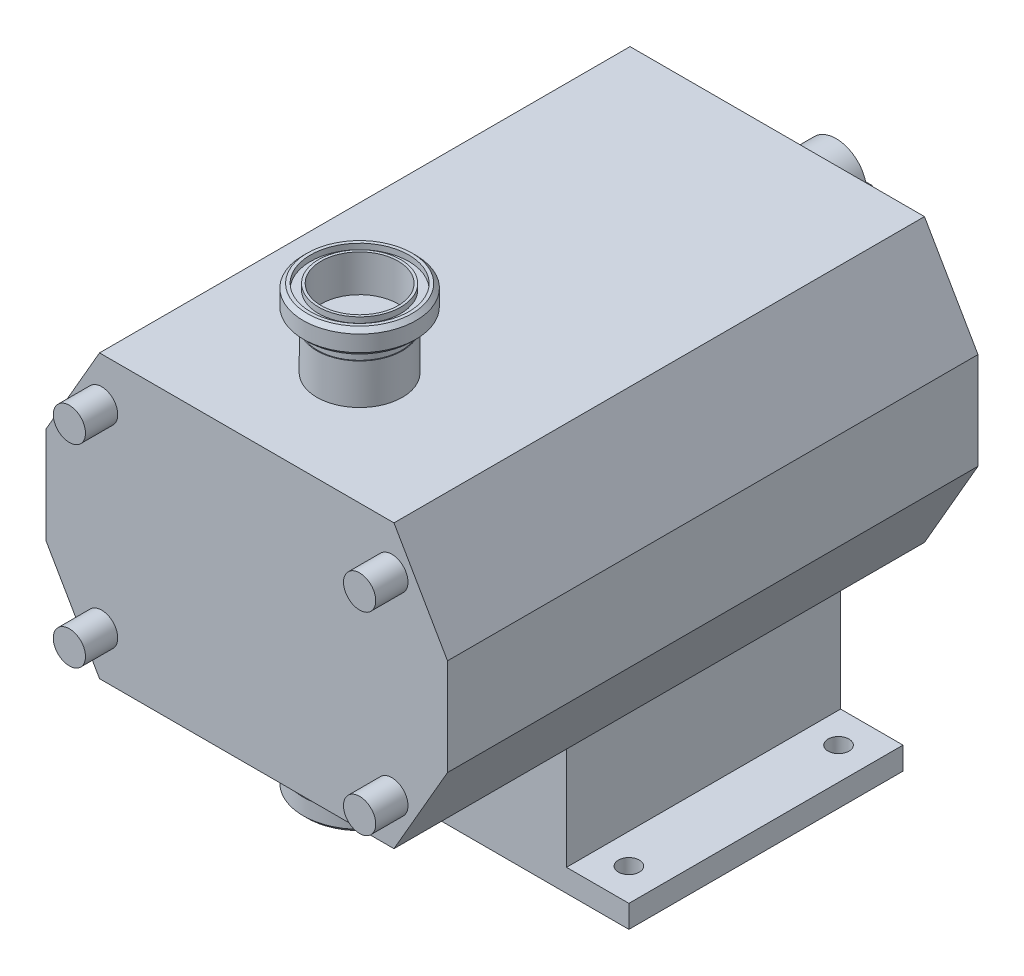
ISO-10303-21;
HEADER;
FILE_DESCRIPTION(('STEP AP214'),'2;1');
FILE_NAME('part.step','',(''),(''),'','','');
FILE_SCHEMA(('AUTOMOTIVE_DESIGN { 1 0 10303 214 1 1 1 1 }'));
ENDSEC;
DATA;
#1=APPLICATION_CONTEXT('core data for automotive mechanical design processes');
#2=APPLICATION_PROTOCOL_DEFINITION('international standard','automotive_design',2000,#1);
#3=PRODUCT_CONTEXT('',#1,'mechanical');
#4=PRODUCT('Part','Part','',(#3));
#5=PRODUCT_RELATED_PRODUCT_CATEGORY('part','',(#4));
#6=PRODUCT_DEFINITION_FORMATION('','',#4);
#7=PRODUCT_DEFINITION_CONTEXT('part definition',#1,'design');
#8=PRODUCT_DEFINITION('design','',#6,#7);
#9=PRODUCT_DEFINITION_SHAPE('','',#8);
#10=(LENGTH_UNIT() NAMED_UNIT(*) SI_UNIT(.MILLI.,.METRE.));
#11=(NAMED_UNIT(*) PLANE_ANGLE_UNIT() SI_UNIT($,.RADIAN.));
#12=(NAMED_UNIT(*) SI_UNIT($,.STERADIAN.) SOLID_ANGLE_UNIT());
#13=UNCERTAINTY_MEASURE_WITH_UNIT(LENGTH_MEASURE(1.E-05),#10,'distance_accuracy_value','');
#14=(GEOMETRIC_REPRESENTATION_CONTEXT(3) GLOBAL_UNCERTAINTY_ASSIGNED_CONTEXT((#13)) GLOBAL_UNIT_ASSIGNED_CONTEXT((#10,
#11,#12)) REPRESENTATION_CONTEXT('',''));
#15=CARTESIAN_POINT('',(0.,0.,0.));
#16=DIRECTION('',(0.,0.,1.));
#17=DIRECTION('',(1.,0.,0.));
#18=AXIS2_PLACEMENT_3D('',#15,#16,#17);
#19=CARTESIAN_POINT('',(25.267696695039,132.,262.434167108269));
#20=DIRECTION('',(0.,1.,0.));
#21=DIRECTION('',(-0.134673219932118,0.,0.990890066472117));
#22=AXIS2_PLACEMENT_3D('',#19,#20,#21);
#23=PLANE('',#22);
#24=CARTESIAN_POINT('',(0.,132.,259.));
#25=DIRECTION('',(0.,-1.,0.));
#26=DIRECTION('',(0.134673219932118,0.,-0.990890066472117));
#27=AXIS2_PLACEMENT_3D('',#24,#25,#26);
#28=CIRCLE('',#27,25.5);
#29=CARTESIAN_POINT('',(3.43416710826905,132.,233.732303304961));
#30=VERTEX_POINT('',#29);
#31=EDGE_CURVE('P0_E57',#30,#30,#28,.T.);
#32=ORIENTED_EDGE('',*,*,#31,.T.);
#33=EDGE_LOOP('',(#32));
#34=FACE_BOUND('',#33,.T.);
#35=CARTESIAN_POINT('',(0.,132.,259.));
#36=DIRECTION('',(0.,-1.,0.));
#37=DIRECTION('',(0.134673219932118,0.,-0.990890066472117));
#38=AXIS2_PLACEMENT_3D('',#35,#36,#37);
#39=CIRCLE('',#38,30.5);
#40=CARTESIAN_POINT('',(4.10753320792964,132.,228.7778529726));
#41=VERTEX_POINT('',#40);
#42=EDGE_CURVE('P0_E9',#41,#41,#39,.T.);
#43=ORIENTED_EDGE('',*,*,#42,.F.);
#44=EDGE_LOOP('',(#43));
#45=FACE_BOUND('',#44,.T.);
#46=ADVANCED_FACE('P0_F14',(#34,#45),#23,.T.);
#47=CARTESIAN_POINT('',(0.,112.5,259.));
#48=DIRECTION('',(0.,-1.,0.));
#49=DIRECTION('',(0.134673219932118,0.,-0.990890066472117));
#50=AXIS2_PLACEMENT_3D('',#47,#48,#49);
#51=CYLINDRICAL_SURFACE('',#50,30.5);
#52=ORIENTED_EDGE('',*,*,#42,.T.);
#53=EDGE_LOOP('',(#52));
#54=FACE_BOUND('',#53,.T.);
#55=CARTESIAN_POINT('',(0.,135.5,259.));
#56=DIRECTION('',(0.,-1.,0.));
#57=DIRECTION('',(0.134673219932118,0.,-0.990890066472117));
#58=AXIS2_PLACEMENT_3D('',#55,#56,#57);
#59=CIRCLE('',#58,30.5);
#60=CARTESIAN_POINT('',(4.10753320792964,135.5,228.7778529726));
#61=VERTEX_POINT('',#60);
#62=EDGE_CURVE('P0_E20',#61,#61,#59,.T.);
#63=ORIENTED_EDGE('',*,*,#62,.F.);
#64=EDGE_LOOP('',(#63));
#65=FACE_BOUND('',#64,.T.);
#66=ADVANCED_FACE('P0_F76',(#54,#65),#51,.F.);
#67=CARTESIAN_POINT('',(30.2221470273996,135.5,263.10753320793));
#68=DIRECTION('',(0.,1.,0.));
#69=DIRECTION('',(-0.134673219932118,0.,0.990890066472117));
#70=AXIS2_PLACEMENT_3D('',#67,#68,#69);
#71=PLANE('',#70);
#72=ORIENTED_EDGE('',*,*,#62,.T.);
#73=EDGE_LOOP('',(#72));
#74=FACE_BOUND('',#73,.T.);
#75=CARTESIAN_POINT('',(0.,135.5,259.));
#76=DIRECTION('',(0.,-1.,0.));
#77=DIRECTION('',(0.134673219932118,0.,-0.990890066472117));
#78=AXIS2_PLACEMENT_3D('',#75,#76,#77);
#79=CIRCLE('',#78,32.5);
#80=CARTESIAN_POINT('',(4.37687964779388,135.5,226.796072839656));
#81=VERTEX_POINT('',#80);
#82=EDGE_CURVE('P0_E24',#81,#81,#79,.T.);
#83=ORIENTED_EDGE('',*,*,#82,.F.);
#84=EDGE_LOOP('',(#83));
#85=FACE_BOUND('',#84,.T.);
#86=ADVANCED_FACE('P0_F80',(#74,#85),#71,.T.);
#87=CARTESIAN_POINT('',(0.,133.,259.));
#88=DIRECTION('',(0.,-1.,0.));
#89=DIRECTION('',(0.134673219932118,0.,-0.990890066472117));
#90=AXIS2_PLACEMENT_3D('',#87,#88,#89);
#91=CONICAL_SURFACE('',#90,35.,0.785398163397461);
#92=ORIENTED_EDGE('',*,*,#82,.T.);
#93=EDGE_LOOP('',(#92));
#94=FACE_BOUND('',#93,.T.);
#95=CARTESIAN_POINT('',(0.,133.,259.));
#96=DIRECTION('',(0.,-1.,0.));
#97=DIRECTION('',(0.134673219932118,0.,-0.990890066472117));
#98=AXIS2_PLACEMENT_3D('',#95,#96,#97);
#99=CIRCLE('',#98,35.);
#100=CARTESIAN_POINT('',(4.71356269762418,133.,224.318847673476));
#101=VERTEX_POINT('',#100);
#102=EDGE_CURVE('P0_E28',#101,#101,#99,.T.);
#103=ORIENTED_EDGE('',*,*,#102,.F.);
#104=EDGE_LOOP('',(#103));
#105=FACE_BOUND('',#104,.T.);
#106=ADVANCED_FACE('P0_F84',(#94,#105),#91,.T.);
#107=CARTESIAN_POINT('',(0.,112.5,259.));
#108=DIRECTION('',(0.,-1.,0.));
#109=DIRECTION('',(0.134673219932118,0.,-0.990890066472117));
#110=AXIS2_PLACEMENT_3D('',#107,#108,#109);
#111=CYLINDRICAL_SURFACE('',#110,35.);
#112=ORIENTED_EDGE('',*,*,#102,.T.);
#113=EDGE_LOOP('',(#112));
#114=FACE_BOUND('',#113,.T.);
#115=CARTESIAN_POINT('',(0.,123.,259.));
#116=DIRECTION('',(0.,-1.,0.));
#117=DIRECTION('',(0.134673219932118,0.,-0.990890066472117));
#118=AXIS2_PLACEMENT_3D('',#115,#116,#117);
#119=CIRCLE('',#118,35.);
#120=CARTESIAN_POINT('',(4.71356269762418,123.,224.318847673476));
#121=VERTEX_POINT('',#120);
#122=EDGE_CURVE('P0_E33',#121,#121,#119,.T.);
#123=ORIENTED_EDGE('',*,*,#122,.F.);
#124=EDGE_LOOP('',(#123));
#125=FACE_BOUND('',#124,.T.);
#126=ADVANCED_FACE('P0_F90',(#114,#125),#111,.T.);
#127=CARTESIAN_POINT('',(0.,120.5,259.));
#128=DIRECTION('',(0.,1.,0.));
#129=DIRECTION('',(-0.134673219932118,0.,0.990890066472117));
#130=AXIS2_PLACEMENT_3D('',#127,#128,#129);
#131=CONICAL_SURFACE('',#130,32.5,0.785398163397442);
#132=ORIENTED_EDGE('',*,*,#122,.T.);
#133=EDGE_LOOP('',(#132));
#134=FACE_BOUND('',#133,.T.);
#135=CARTESIAN_POINT('',(0.,120.5,259.));
#136=DIRECTION('',(0.,-1.,0.));
#137=DIRECTION('',(0.134673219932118,0.,-0.990890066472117));
#138=AXIS2_PLACEMENT_3D('',#135,#136,#137);
#139=CIRCLE('',#138,32.5);
#140=CARTESIAN_POINT('',(4.37687964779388,120.5,226.796072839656));
#141=VERTEX_POINT('',#140);
#142=EDGE_CURVE('P0_E36',#141,#141,#139,.T.);
#143=ORIENTED_EDGE('',*,*,#142,.F.);
#144=EDGE_LOOP('',(#143));
#145=FACE_BOUND('',#144,.T.);
#146=ADVANCED_FACE('P0_F94',(#134,#145),#131,.T.);
#147=CARTESIAN_POINT('',(32.2039271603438,120.5,263.376879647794));
#148=DIRECTION('',(0.,-1.,0.));
#149=DIRECTION('',(0.134673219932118,0.,-0.990890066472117));
#150=AXIS2_PLACEMENT_3D('',#147,#148,#149);
#151=PLANE('',#150);
#152=ORIENTED_EDGE('',*,*,#142,.T.);
#153=EDGE_LOOP('',(#152));
#154=FACE_BOUND('',#153,.T.);
#155=CARTESIAN_POINT('',(0.,120.5,259.));
#156=DIRECTION('',(0.,-1.,0.));
#157=DIRECTION('',(0.134673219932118,0.,-0.990890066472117));
#158=AXIS2_PLACEMENT_3D('',#155,#156,#157);
#159=CIRCLE('',#158,28.5);
#160=CARTESIAN_POINT('',(3.83818676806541,120.5,230.759633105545));
#161=VERTEX_POINT('',#160);
#162=EDGE_CURVE('P0_E39',#161,#161,#159,.T.);
#163=ORIENTED_EDGE('',*,*,#162,.F.);
#164=EDGE_LOOP('',(#163));
#165=FACE_BOUND('',#164,.T.);
#166=ADVANCED_FACE('P0_F98',(#154,#165),#151,.T.);
#167=CARTESIAN_POINT('',(0.,118.,259.));
#168=DIRECTION('',(0.,-1.,0.));
#169=DIRECTION('',(0.134673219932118,0.,-0.990890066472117));
#170=AXIS2_PLACEMENT_3D('',#167,#168,#169);
#171=TOROIDAL_SURFACE('',#170,28.5,2.5);
#172=ORIENTED_EDGE('',*,*,#162,.T.);
#173=EDGE_LOOP('',(#172));
#174=FACE_BOUND('',#173,.T.);
#175=CARTESIAN_POINT('',(0.,118.,259.));
#176=DIRECTION('',(0.,-1.,0.));
#177=DIRECTION('',(0.134673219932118,0.,-0.990890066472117));
#178=AXIS2_PLACEMENT_3D('',#175,#176,#177);
#179=CIRCLE('',#178,26.);
#180=CARTESIAN_POINT('',(3.50150371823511,118.,233.236858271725));
#181=VERTEX_POINT('',#180);
#182=EDGE_CURVE('P0_E42',#181,#181,#179,.T.);
#183=ORIENTED_EDGE('',*,*,#182,.F.);
#184=EDGE_LOOP('',(#183));
#185=FACE_BOUND('',#184,.T.);
#186=ADVANCED_FACE('P0_F102',(#174,#185),#171,.F.);
#187=CARTESIAN_POINT('',(0.,112.5,259.));
#188=DIRECTION('',(0.,-1.,0.));
#189=DIRECTION('',(0.134673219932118,0.,-0.990890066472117));
#190=AXIS2_PLACEMENT_3D('',#187,#188,#189);
#191=CYLINDRICAL_SURFACE('',#190,26.);
#192=ORIENTED_EDGE('',*,*,#182,.T.);
#193=EDGE_LOOP('',(#192));
#194=FACE_BOUND('',#193,.T.);
#195=CARTESIAN_POINT('',(0.,112.5,259.));
#196=DIRECTION('',(0.,-1.,0.));
#197=DIRECTION('',(0.134673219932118,0.,-0.990890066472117));
#198=AXIS2_PLACEMENT_3D('',#195,#196,#197);
#199=CIRCLE('',#198,26.);
#200=CARTESIAN_POINT('',(3.50150371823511,112.5,233.236858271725));
#201=VERTEX_POINT('',#200);
#202=EDGE_CURVE('P0_E45',#201,#201,#199,.T.);
#203=ORIENTED_EDGE('',*,*,#202,.F.);
#204=EDGE_LOOP('',(#203));
#205=FACE_BOUND('',#204,.T.);
#206=ADVANCED_FACE('P0_F106',(#194,#205),#191,.T.);
#207=CARTESIAN_POINT('',(25.7631417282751,112.5,262.501503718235));
#208=DIRECTION('',(0.,-1.,0.));
#209=DIRECTION('',(0.134673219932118,0.,-0.990890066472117));
#210=AXIS2_PLACEMENT_3D('',#207,#208,#209);
#211=PLANE('',#210);
#212=ORIENTED_EDGE('',*,*,#202,.T.);
#213=EDGE_LOOP('',(#212));
#214=FACE_BOUND('',#213,.T.);
#215=CARTESIAN_POINT('',(0.,112.5,259.));
#216=DIRECTION('',(0.,-1.,0.));
#217=DIRECTION('',(0.134673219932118,0.,-0.990890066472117));
#218=AXIS2_PLACEMENT_3D('',#215,#216,#217);
#219=CIRCLE('',#218,23.9);
#220=CARTESIAN_POINT('',(3.21868995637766,112.5,235.317727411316));
#221=VERTEX_POINT('',#220);
#222=EDGE_CURVE('P0_E48',#221,#221,#219,.T.);
#223=ORIENTED_EDGE('',*,*,#222,.F.);
#224=EDGE_LOOP('',(#223));
#225=FACE_BOUND('',#224,.T.);
#226=ADVANCED_FACE('P0_F110',(#214,#225),#211,.T.);
#227=CARTESIAN_POINT('',(0.,112.5,259.));
#228=DIRECTION('',(0.,-1.,0.));
#229=DIRECTION('',(0.134673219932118,0.,-0.990890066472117));
#230=AXIS2_PLACEMENT_3D('',#227,#228,#229);
#231=CYLINDRICAL_SURFACE('',#230,23.9);
#232=ORIENTED_EDGE('',*,*,#222,.T.);
#233=EDGE_LOOP('',(#232));
#234=FACE_BOUND('',#233,.T.);
#235=CARTESIAN_POINT('',(0.,135.5,259.));
#236=DIRECTION('',(0.,-1.,0.));
#237=DIRECTION('',(0.134673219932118,0.,-0.990890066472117));
#238=AXIS2_PLACEMENT_3D('',#235,#236,#237);
#239=CIRCLE('',#238,23.9);
#240=CARTESIAN_POINT('',(3.21868995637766,135.5,235.317727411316));
#241=VERTEX_POINT('',#240);
#242=EDGE_CURVE('P0_E51',#241,#241,#239,.T.);
#243=ORIENTED_EDGE('',*,*,#242,.F.);
#244=EDGE_LOOP('',(#243));
#245=FACE_BOUND('',#244,.T.);
#246=ADVANCED_FACE('P0_F72',(#234,#245),#231,.F.);
#247=CARTESIAN_POINT('',(23.6822725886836,135.5,262.218689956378));
#248=DIRECTION('',(0.,1.,0.));
#249=DIRECTION('',(-0.134673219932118,0.,0.990890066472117));
#250=AXIS2_PLACEMENT_3D('',#247,#248,#249);
#251=PLANE('',#250);
#252=ORIENTED_EDGE('',*,*,#242,.T.);
#253=EDGE_LOOP('',(#252));
#254=FACE_BOUND('',#253,.T.);
#255=CARTESIAN_POINT('',(0.,135.5,259.));
#256=DIRECTION('',(0.,-1.,0.));
#257=DIRECTION('',(0.134673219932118,0.,-0.990890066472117));
#258=AXIS2_PLACEMENT_3D('',#255,#256,#257);
#259=CIRCLE('',#258,25.5);
#260=CARTESIAN_POINT('',(3.43416710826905,135.5,233.732303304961));
#261=VERTEX_POINT('',#260);
#262=EDGE_CURVE('P0_E54',#261,#261,#259,.T.);
#263=ORIENTED_EDGE('',*,*,#262,.F.);
#264=EDGE_LOOP('',(#263));
#265=FACE_BOUND('',#264,.T.);
#266=ADVANCED_FACE('P0_F65',(#254,#265),#251,.T.);
#267=CARTESIAN_POINT('',(0.,112.5,259.));
#268=DIRECTION('',(0.,-1.,0.));
#269=DIRECTION('',(0.134673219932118,0.,-0.990890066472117));
#270=AXIS2_PLACEMENT_3D('',#267,#268,#269);
#271=CYLINDRICAL_SURFACE('',#270,25.5);
#272=ORIENTED_EDGE('',*,*,#262,.T.);
#273=EDGE_LOOP('',(#272));
#274=FACE_BOUND('',#273,.T.);
#275=ORIENTED_EDGE('',*,*,#31,.F.);
#276=EDGE_LOOP('',(#275));
#277=FACE_BOUND('',#276,.T.);
#278=ADVANCED_FACE('P0_F63',(#274,#277),#271,.T.);
#279=CLOSED_SHELL('',(#46,#66,#86,#106,#126,#146,#166,#186,#206,#226,#246,#266,#278));
#280=MANIFOLD_SOLID_BREP('P0_B1',#279);
#281=CARTESIAN_POINT('',(-46.5,0.,241.732657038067));
#282=DIRECTION('',(0.,0.,1.));
#283=DIRECTION('',(1.,0.,0.));
#284=AXIS2_PLACEMENT_3D('',#281,#282,#283);
#285=CYLINDRICAL_SURFACE('',#284,19.);
#286=CARTESIAN_POINT('',(-46.5,0.,-3.));
#287=DIRECTION('',(0.,0.,1.));
#288=DIRECTION('',(1.,0.,0.));
#289=AXIS2_PLACEMENT_3D('',#286,#287,#288);
#290=CIRCLE('',#289,19.);
#291=CARTESIAN_POINT('',(-27.5,0.,-3.));
#292=VERTEX_POINT('',#291);
#293=EDGE_CURVE('P1_E277',#292,#292,#290,.T.);
#294=ORIENTED_EDGE('',*,*,#293,.F.);
#295=EDGE_LOOP('',(#294));
#296=FACE_BOUND('',#295,.T.);
#297=DIRECTION('',(0.,0.,1.));
#298=VECTOR('',#297,1.);
#299=CARTESIAN_POINT('',(-28.1696972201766,4.99999999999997,241.732657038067));
#300=LINE('',#299,#298);
#301=CARTESIAN_POINT('',(-28.1696972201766,5.,-83.));
#302=VERTEX_POINT('',#301);
#303=CARTESIAN_POINT('',(-28.1696972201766,5.,-43.));
#304=VERTEX_POINT('',#303);
#305=EDGE_CURVE('P1_E178',#302,#304,#300,.T.);
#306=ORIENTED_EDGE('',*,*,#305,.F.);
#307=CARTESIAN_POINT('',(-46.5,0.,-83.));
#308=DIRECTION('',(0.,0.,1.));
#309=DIRECTION('',(1.,0.,0.));
#310=AXIS2_PLACEMENT_3D('',#307,#308,#309);
#311=CIRCLE('',#310,19.);
#312=CARTESIAN_POINT('',(-28.1696972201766,-5.,-83.));
#313=VERTEX_POINT('',#312);
#314=EDGE_CURVE('P1_E176',#302,#313,#311,.T.);
#315=ORIENTED_EDGE('',*,*,#314,.T.);
#316=DIRECTION('',(0.,0.,1.));
#317=VECTOR('',#316,1.);
#318=CARTESIAN_POINT('',(-28.1696972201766,-5.00000000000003,241.732657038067));
#319=LINE('',#318,#317);
#320=CARTESIAN_POINT('',(-28.1696972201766,-5.00000000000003,-43.));
#321=VERTEX_POINT('',#320);
#322=EDGE_CURVE('P1_E39',#321,#313,#319,.F.);
#323=ORIENTED_EDGE('',*,*,#322,.F.);
#324=CARTESIAN_POINT('',(-27.5,0.,-48.));
#325=CARTESIAN_POINT('',(-27.5000042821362,0.275769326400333,-47.9999931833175));
#326=CARTESIAN_POINT('',(-27.5060630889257,0.551612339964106,-47.9771088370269));
#327=CARTESIAN_POINT('',(-27.5296447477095,1.09536084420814,-47.8863327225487));
#328=CARTESIAN_POINT('',(-27.5471733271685,1.36326229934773,-47.8184184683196));
#329=CARTESIAN_POINT('',(-27.5917584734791,1.88319959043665,-47.6399368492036));
#330=CARTESIAN_POINT('',(-27.6188029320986,2.1352551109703,-47.5294236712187));
#331=CARTESIAN_POINT('',(-27.6795569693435,2.61725305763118,-47.2690799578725));
#332=CARTESIAN_POINT('',(-27.7132669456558,2.84719416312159,-47.1192470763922));
#333=CARTESIAN_POINT('',(-27.7845611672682,3.2836398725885,-46.7809367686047));
#334=CARTESIAN_POINT('',(-27.8222102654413,3.48957269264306,-46.591735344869));
#335=CARTESIAN_POINT('',(-27.8967199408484,3.86718169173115,-46.1816068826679));
#336=CARTESIAN_POINT('',(-27.9335804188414,4.03885358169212,-45.9606758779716));
#337=CARTESIAN_POINT('',(-28.0030006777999,4.34583417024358,-45.4888224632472));
#338=CARTESIAN_POINT('',(-28.0354785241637,4.48048899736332,-45.237461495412));
#339=CARTESIAN_POINT('',(-28.0915043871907,4.7054029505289,-44.7146757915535));
#340=CARTESIAN_POINT('',(-28.1150540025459,4.79567002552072,-44.4432546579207));
#341=CARTESIAN_POINT('',(-28.1498881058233,4.92726790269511,-43.8943761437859));
#342=CARTESIAN_POINT('',(-28.1614315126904,4.96963355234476,-43.6171837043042));
#343=CARTESIAN_POINT('',(-28.171720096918,5.00745164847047,-43.0594039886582));
#344=CARTESIAN_POINT('',(-28.1704675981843,5.00291261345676,-42.7788173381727));
#345=CARTESIAN_POINT('',(-28.1555378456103,4.9478726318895,-42.2302595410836));
#346=CARTESIAN_POINT('',(-28.1421979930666,4.89861973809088,-41.9621525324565));
#347=CARTESIAN_POINT('',(-28.1051362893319,4.75754734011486,-41.4381479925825));
#348=CARTESIAN_POINT('',(-28.0814136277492,4.6657245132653,-41.1822514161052));
#349=CARTESIAN_POINT('',(-28.0259597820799,4.44109179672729,-40.6866584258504));
#350=CARTESIAN_POINT('',(-27.9941431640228,4.30784106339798,-40.4471717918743));
#351=CARTESIAN_POINT('',(-27.926132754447,4.00444274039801,-39.9935172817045));
#352=CARTESIAN_POINT('',(-27.8899381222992,3.83428805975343,-39.7793542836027));
#353=CARTESIAN_POINT('',(-27.8158419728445,3.45551254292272,-39.3752910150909));
#354=CARTESIAN_POINT('',(-27.7779227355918,3.24584253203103,-39.1863761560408));
#355=CARTESIAN_POINT('',(-27.705680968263,2.79733618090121,-38.8461906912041));
#356=CARTESIAN_POINT('',(-27.671358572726,2.55849875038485,-38.6949214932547));
#357=CARTESIAN_POINT('',(-27.6099756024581,2.05693717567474,-38.4339031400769));
#358=CARTESIAN_POINT('',(-27.5829456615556,1.79411828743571,-38.3243283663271));
#359=CARTESIAN_POINT('',(-27.5394148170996,1.25291705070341,-38.151199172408));
#360=CARTESIAN_POINT('',(-27.5229116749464,0.974538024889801,-38.0876349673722));
#361=CARTESIAN_POINT('',(-27.5026308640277,0.418531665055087,-38.009869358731));
#362=CARTESIAN_POINT('',(-27.4985077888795,0.141104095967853,-37.9943277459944));
#363=CARTESIAN_POINT('',(-27.5024606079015,-0.412392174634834,-38.0093527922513));
#364=CARTESIAN_POINT('',(-27.5105352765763,-0.688461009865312,-38.0399148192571));
#365=CARTESIAN_POINT('',(-27.5377535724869,-1.22664703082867,-38.1451790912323));
#366=CARTESIAN_POINT('',(-27.5567105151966,-1.48892004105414,-38.2191373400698));
#367=CARTESIAN_POINT('',(-27.6035461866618,-1.99731390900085,-38.4082337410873));
#368=CARTESIAN_POINT('',(-27.6314258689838,-2.24343303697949,-38.5233762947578));
#369=CARTESIAN_POINT('',(-27.6938277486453,-2.71776721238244,-38.7940826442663));
#370=CARTESIAN_POINT('',(-27.7284672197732,-2.9455476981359,-38.9503801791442));
#371=CARTESIAN_POINT('',(-27.8003827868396,-3.3721194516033,-39.298034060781));
#372=CARTESIAN_POINT('',(-27.8376593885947,-3.5709051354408,-39.4893971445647));
#373=CARTESIAN_POINT('',(-27.9119129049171,-3.93946537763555,-39.9079980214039));
#374=CARTESIAN_POINT('',(-27.9488536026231,-4.10829545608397,-40.1360753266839));
#375=CARTESIAN_POINT('',(-28.0171260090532,-4.40530154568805,-40.6181009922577));
#376=CARTESIAN_POINT('',(-28.048457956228,-4.5334792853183,-40.8720482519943));
#377=CARTESIAN_POINT('',(-28.1016076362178,-4.74457728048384,-41.3973124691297));
#378=CARTESIAN_POINT('',(-28.1234807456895,-4.82776168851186,-41.6685173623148));
#379=CARTESIAN_POINT('',(-28.1552579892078,-4.94715371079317,-42.2217364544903));
#380=CARTESIAN_POINT('',(-28.1651650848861,-4.98337294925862,-42.5037479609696));
#381=CARTESIAN_POINT('',(-28.1716457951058,-5.00715081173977,-43.0609183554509));
#382=CARTESIAN_POINT('',(-28.1686348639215,-4.99622557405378,-43.3360086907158));
#383=CARTESIAN_POINT('',(-28.1505888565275,-4.92953140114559,-43.8802760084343));
#384=CARTESIAN_POINT('',(-28.1355540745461,-4.87376356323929,-44.1494531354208));
#385=CARTESIAN_POINT('',(-28.095398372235,-4.71983552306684,-44.6724009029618));
#386=CARTESIAN_POINT('',(-28.0703520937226,-4.6219886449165,-44.9262699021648));
#387=CARTESIAN_POINT('',(-28.012991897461,-4.38692411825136,-45.4141783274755));
#388=CARTESIAN_POINT('',(-27.9806768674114,-4.24970044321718,-45.648214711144));
#389=CARTESIAN_POINT('',(-27.9112611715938,-3.93514861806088,-46.0970708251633));
#390=CARTESIAN_POINT('',(-27.8740497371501,-3.7567820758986,-46.3111458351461));
#391=CARTESIAN_POINT('',(-27.7996615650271,-3.36699304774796,-46.7068188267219));
#392=CARTESIAN_POINT('',(-27.7624848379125,-3.15556257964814,-46.8884089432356));
#393=CARTESIAN_POINT('',(-27.6914364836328,-2.7003741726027,-47.2176404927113));
#394=CARTESIAN_POINT('',(-27.6576490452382,-2.45603841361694,-47.3645027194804));
#395=CARTESIAN_POINT('',(-27.5980996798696,-1.94526775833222,-47.6148349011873));
#396=CARTESIAN_POINT('',(-27.5723324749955,-1.67884754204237,-47.7183334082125));
#397=CARTESIAN_POINT('',(-27.5351625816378,-1.17775159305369,-47.8650961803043));
#398=CARTESIAN_POINT('',(-27.5220714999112,-0.945286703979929,-47.9155694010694));
#399=CARTESIAN_POINT('',(-27.5044887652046,-0.475232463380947,-47.9830226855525));
#400=CARTESIAN_POINT('',(-27.4999963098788,-0.237643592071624,-48.0000058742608));
#401=CARTESIAN_POINT('',(-27.5,0.,-48.));
#402=B_SPLINE_CURVE_WITH_KNOTS('',3,(#324,#325,#326,#327,#328,#329,#330,#331,#332,#333,#334,
#335,#336,#337,#338,#339,#340,#341,#342,#343,#344,#345,#346,#347,#348,#349,#350,#351,#352,#353,
#354,#355,#356,#357,#358,#359,#360,#361,#362,#363,#364,#365,#366,#367,#368,#369,#370,#371,#372,
#373,#374,#375,#376,#377,#378,#379,#380,#381,#382,#383,#384,#385,#386,#387,#388,#389,#390,#391,
#392,#393,#394,#395,#396,#397,#398,#399,#400,#401),.UNSPECIFIED.,.T.,.F.,(4,2,2,2,2,2,2,2,2,2,2,
2,2,2,2,2,2,2,2,2,2,2,2,2,2,2,2,2,2,2,2,2,2,2,2,2,2,2,4),(0.,0.826436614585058,1.65328622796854,
2.47908752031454,3.30493809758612,4.14758534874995,4.99033802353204,5.84713921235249,
6.70378690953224,7.54155141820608,8.37916378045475,9.19409222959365,10.0090842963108,
10.8330642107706,11.6572025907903,12.5074895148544,13.35780823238,14.2116451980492,
15.0653005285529,15.8949065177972,16.7244291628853,17.5401294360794,18.3559169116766,
19.187369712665,20.0189824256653,20.873388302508,21.7277578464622,22.577055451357,
23.4261428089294,24.2481310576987,25.0700991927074,25.8860500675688,26.702125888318,
27.5416338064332,28.3813447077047,29.2384104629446,30.0949110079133,30.8071573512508,
31.5193372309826),.UNSPECIFIED.);
#403=EDGE_CURVE('P1_E11',#304,#321,#402,.T.);
#404=ORIENTED_EDGE('',*,*,#403,.F.);
#405=EDGE_LOOP('',(#306,#315,#323,#404));
#406=FACE_BOUND('',#405,.T.);
#407=ADVANCED_FACE('P1_F17',(#296,#406),#285,.T.);
#408=CARTESIAN_POINT('',(-91.3023595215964,-87.5,329.));
#409=DIRECTION('',(0.,1.,0.));
#410=DIRECTION('',(-1.,0.,0.));
#411=AXIS2_PLACEMENT_3D('',#408,#409,#410);
#412=PLANE('',#411);
#413=CARTESIAN_POINT('',(0.,-87.5,259.));
#414=DIRECTION('',(0.,1.,0.));
#415=DIRECTION('',(-1.,0.,0.));
#416=AXIS2_PLACEMENT_3D('',#413,#414,#415);
#417=CIRCLE('',#416,26.5);
#418=CARTESIAN_POINT('',(-26.5,-87.5,259.));
#419=VERTEX_POINT('',#418);
#420=EDGE_CURVE('P1_E192',#419,#419,#417,.T.);
#421=ORIENTED_EDGE('',*,*,#420,.T.);
#422=EDGE_LOOP('',(#421));
#423=FACE_BOUND('',#422,.T.);
#424=DIRECTION('',(1.,0.,0.));
#425=VECTOR('',#424,1.);
#426=CARTESIAN_POINT('',(-91.3023595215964,-87.5,0.));
#427=LINE('',#426,#425);
#428=CARTESIAN_POINT('',(-91.3023595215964,-87.5,0.));
#429=VERTEX_POINT('',#428);
#430=CARTESIAN_POINT('',(91.3023595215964,-87.5,0.));
#431=VERTEX_POINT('',#430);
#432=EDGE_CURVE('P1_E328',#429,#431,#427,.T.);
#433=ORIENTED_EDGE('',*,*,#432,.T.);
#434=DIRECTION('',(0.,0.,-1.));
#435=VECTOR('',#434,1.);
#436=CARTESIAN_POINT('',(91.3023595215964,-87.5,329.));
#437=LINE('',#436,#435);
#438=CARTESIAN_POINT('',(91.3023595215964,-87.5,329.));
#439=VERTEX_POINT('',#438);
#440=EDGE_CURVE('P1_E338',#439,#431,#437,.T.);
#441=ORIENTED_EDGE('',*,*,#440,.F.);
#442=DIRECTION('',(1.,0.,0.));
#443=VECTOR('',#442,1.);
#444=CARTESIAN_POINT('',(-91.3023595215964,-87.5,329.));
#445=LINE('',#444,#443);
#446=CARTESIAN_POINT('',(-91.3023595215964,-87.5,329.));
#447=VERTEX_POINT('',#446);
#448=EDGE_CURVE('P1_E311',#447,#439,#445,.T.);
#449=ORIENTED_EDGE('',*,*,#448,.F.);
#450=DIRECTION('',(0.,0.,-1.));
#451=VECTOR('',#450,1.);
#452=CARTESIAN_POINT('',(-91.3023595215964,-87.5,329.));
#453=LINE('',#452,#451);
#454=EDGE_CURVE('P1_E341',#447,#429,#453,.T.);
#455=ORIENTED_EDGE('',*,*,#454,.T.);
#456=EDGE_LOOP('',(#433,#441,#449,#455));
#457=FACE_BOUND('',#456,.T.);
#458=DIRECTION('',(1.,0.,0.));
#459=VECTOR('',#458,1.);
#460=CARTESIAN_POINT('',(66.3023595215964,-87.5,27.));
#461=LINE('',#460,#459);
#462=CARTESIAN_POINT('',(-66.3023595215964,-87.5,27.));
#463=VERTEX_POINT('',#462);
#464=CARTESIAN_POINT('',(66.3023595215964,-87.5,27.));
#465=VERTEX_POINT('',#464);
#466=EDGE_CURVE('P1_E220',#463,#465,#461,.T.);
#467=ORIENTED_EDGE('',*,*,#466,.F.);
#468=DIRECTION('',(0.,0.,1.));
#469=VECTOR('',#468,1.);
#470=CARTESIAN_POINT('',(-66.3023595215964,-87.5,27.));
#471=LINE('',#470,#469);
#472=CARTESIAN_POINT('',(-66.3023595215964,-87.5,197.));
#473=VERTEX_POINT('',#472);
#474=EDGE_CURVE('P1_E238',#463,#473,#471,.T.);
#475=ORIENTED_EDGE('',*,*,#474,.T.);
#476=DIRECTION('',(1.,0.,0.));
#477=VECTOR('',#476,1.);
#478=CARTESIAN_POINT('',(66.3023595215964,-87.5,197.));
#479=LINE('',#478,#477);
#480=CARTESIAN_POINT('',(66.3023595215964,-87.5,197.));
#481=VERTEX_POINT('',#480);
#482=EDGE_CURVE('P1_E219',#473,#481,#479,.T.);
#483=ORIENTED_EDGE('',*,*,#482,.T.);
#484=DIRECTION('',(0.,0.,1.));
#485=VECTOR('',#484,1.);
#486=CARTESIAN_POINT('',(66.3023595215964,-87.5,27.));
#487=LINE('',#486,#485);
#488=EDGE_CURVE('P1_E274',#465,#481,#487,.T.);
#489=ORIENTED_EDGE('',*,*,#488,.F.);
#490=EDGE_LOOP('',(#467,#475,#483,#489));
#491=FACE_BOUND('',#490,.T.);
#492=ADVANCED_FACE('P1_F393',(#423,#457,#491),#412,.F.);
#493=CARTESIAN_POINT('',(0.,245.640325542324,0.));
#494=DIRECTION('',(0.,0.,-1.));
#495=DIRECTION('',(-1.,0.,0.));
#496=AXIS2_PLACEMENT_3D('',#493,#494,#495);
#497=PLANE('',#496);
#498=DIRECTION('',(-0.500000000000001,0.866025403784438,0.));
#499=VECTOR('',#498,1.);
#500=CARTESIAN_POINT('',(91.3023595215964,87.5,0.));
#501=LINE('',#500,#499);
#502=CARTESIAN_POINT('',(124.5,30.,0.));
#503=VERTEX_POINT('',#502);
#504=CARTESIAN_POINT('',(91.3023595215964,87.5,0.));
#505=VERTEX_POINT('',#504);
#506=EDGE_CURVE('P1_E298',#503,#505,#501,.T.);
#507=ORIENTED_EDGE('',*,*,#506,.F.);
#508=DIRECTION('',(0.,1.,0.));
#509=VECTOR('',#508,1.);
#510=CARTESIAN_POINT('',(124.5,30.,0.));
#511=LINE('',#510,#509);
#512=CARTESIAN_POINT('',(124.5,-30.,0.));
#513=VERTEX_POINT('',#512);
#514=EDGE_CURVE('P1_E303',#513,#503,#511,.T.);
#515=ORIENTED_EDGE('',*,*,#514,.F.);
#516=DIRECTION('',(0.500000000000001,0.866025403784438,0.));
#517=VECTOR('',#516,1.);
#518=CARTESIAN_POINT('',(91.3023595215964,-87.5,0.));
#519=LINE('',#518,#517);
#520=EDGE_CURVE('P1_E330',#431,#513,#519,.T.);
#521=ORIENTED_EDGE('',*,*,#520,.F.);
#522=ORIENTED_EDGE('',*,*,#432,.F.);
#523=DIRECTION('',(0.500000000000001,-0.866025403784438,0.));
#524=VECTOR('',#523,1.);
#525=CARTESIAN_POINT('',(-91.3023595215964,-87.5,0.));
#526=LINE('',#525,#524);
#527=CARTESIAN_POINT('',(-124.5,-30.,0.));
#528=VERTEX_POINT('',#527);
#529=EDGE_CURVE('P1_E326',#528,#429,#526,.T.);
#530=ORIENTED_EDGE('',*,*,#529,.F.);
#531=DIRECTION('',(0.,-1.,0.));
#532=VECTOR('',#531,1.);
#533=CARTESIAN_POINT('',(-124.5,30.,0.));
#534=LINE('',#533,#532);
#535=CARTESIAN_POINT('',(-124.5,30.,0.));
#536=VERTEX_POINT('',#535);
#537=EDGE_CURVE('P1_E324',#536,#528,#534,.T.);
#538=ORIENTED_EDGE('',*,*,#537,.F.);
#539=DIRECTION('',(-0.500000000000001,-0.866025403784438,0.));
#540=VECTOR('',#539,1.);
#541=CARTESIAN_POINT('',(-91.3023595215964,87.5,0.));
#542=LINE('',#541,#540);
#543=CARTESIAN_POINT('',(-91.3023595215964,87.5,0.));
#544=VERTEX_POINT('',#543);
#545=EDGE_CURVE('P1_E322',#544,#536,#542,.T.);
#546=ORIENTED_EDGE('',*,*,#545,.F.);
#547=DIRECTION('',(-1.,0.,0.));
#548=VECTOR('',#547,1.);
#549=CARTESIAN_POINT('',(-91.3023595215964,87.5,0.));
#550=LINE('',#549,#548);
#551=EDGE_CURVE('P1_E320',#505,#544,#550,.T.);
#552=ORIENTED_EDGE('',*,*,#551,.F.);
#553=EDGE_LOOP('',(#507,#515,#521,#522,#530,#538,#546,#552));
#554=FACE_BOUND('',#553,.T.);
#555=CARTESIAN_POINT('',(-46.5,0.,0.));
#556=DIRECTION('',(0.,0.,1.));
#557=DIRECTION('',(1.,0.,0.));
#558=AXIS2_PLACEMENT_3D('',#555,#556,#557);
#559=CIRCLE('',#558,22.);
#560=CARTESIAN_POINT('',(-24.5,0.,0.));
#561=VERTEX_POINT('',#560);
#562=EDGE_CURVE('P1_E283',#561,#561,#559,.T.);
#563=ORIENTED_EDGE('',*,*,#562,.T.);
#564=EDGE_LOOP('',(#563));
#565=FACE_BOUND('',#564,.T.);
#566=ADVANCED_FACE('P1_F399',(#554,#565),#497,.T.);
#567=CARTESIAN_POINT('',(0.,245.640325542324,329.));
#568=DIRECTION('',(0.,0.,-1.));
#569=DIRECTION('',(-1.,0.,0.));
#570=AXIS2_PLACEMENT_3D('',#567,#568,#569);
#571=PLANE('',#570);
#572=CARTESIAN_POINT('',(90.,-60.,329.));
#573=DIRECTION('',(0.,0.,-1.));
#574=DIRECTION('',(-1.,0.,0.));
#575=AXIS2_PLACEMENT_3D('',#572,#573,#574);
#576=CIRCLE('',#575,9.99999999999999);
#577=CARTESIAN_POINT('',(80.,-60.,329.));
#578=VERTEX_POINT('',#577);
#579=EDGE_CURVE('P1_E362',#578,#578,#576,.F.);
#580=ORIENTED_EDGE('',*,*,#579,.F.);
#581=EDGE_LOOP('',(#580));
#582=FACE_BOUND('',#581,.T.);
#583=CARTESIAN_POINT('',(-90.,60.,329.));
#584=DIRECTION('',(0.,0.,-1.));
#585=DIRECTION('',(-1.,0.,0.));
#586=AXIS2_PLACEMENT_3D('',#583,#584,#585);
#587=CIRCLE('',#586,9.99999999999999);
#588=CARTESIAN_POINT('',(-100.,60.,329.));
#589=VERTEX_POINT('',#588);
#590=EDGE_CURVE('P1_E356',#589,#589,#587,.F.);
#591=ORIENTED_EDGE('',*,*,#590,.F.);
#592=EDGE_LOOP('',(#591));
#593=FACE_BOUND('',#592,.T.);
#594=DIRECTION('',(-0.500000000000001,0.866025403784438,0.));
#595=VECTOR('',#594,1.);
#596=CARTESIAN_POINT('',(91.3023595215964,87.5,329.));
#597=LINE('',#596,#595);
#598=CARTESIAN_POINT('',(124.5,30.,329.));
#599=VERTEX_POINT('',#598);
#600=CARTESIAN_POINT('',(91.3023595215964,87.5,329.));
#601=VERTEX_POINT('',#600);
#602=EDGE_CURVE('P1_E299',#599,#601,#597,.T.);
#603=ORIENTED_EDGE('',*,*,#602,.T.);
#604=DIRECTION('',(-1.,0.,0.));
#605=VECTOR('',#604,1.);
#606=CARTESIAN_POINT('',(-91.3023595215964,87.5,329.));
#607=LINE('',#606,#605);
#608=CARTESIAN_POINT('',(-91.3023595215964,87.5,329.));
#609=VERTEX_POINT('',#608);
#610=EDGE_CURVE('P1_E302',#601,#609,#607,.T.);
#611=ORIENTED_EDGE('',*,*,#610,.T.);
#612=DIRECTION('',(-0.500000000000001,-0.866025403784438,0.));
#613=VECTOR('',#612,1.);
#614=CARTESIAN_POINT('',(-91.3023595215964,87.5,329.));
#615=LINE('',#614,#613);
#616=CARTESIAN_POINT('',(-124.5,30.,329.));
#617=VERTEX_POINT('',#616);
#618=EDGE_CURVE('P1_E305',#609,#617,#615,.T.);
#619=ORIENTED_EDGE('',*,*,#618,.T.);
#620=DIRECTION('',(0.,-1.,0.));
#621=VECTOR('',#620,1.);
#622=CARTESIAN_POINT('',(-124.5,30.,329.));
#623=LINE('',#622,#621);
#624=CARTESIAN_POINT('',(-124.5,-30.,329.));
#625=VERTEX_POINT('',#624);
#626=EDGE_CURVE('P1_E307',#617,#625,#623,.T.);
#627=ORIENTED_EDGE('',*,*,#626,.T.);
#628=DIRECTION('',(0.500000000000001,-0.866025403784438,0.));
#629=VECTOR('',#628,1.);
#630=CARTESIAN_POINT('',(-91.3023595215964,-87.5,329.));
#631=LINE('',#630,#629);
#632=EDGE_CURVE('P1_E309',#625,#447,#631,.T.);
#633=ORIENTED_EDGE('',*,*,#632,.T.);
#634=ORIENTED_EDGE('',*,*,#448,.T.);
#635=DIRECTION('',(0.500000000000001,0.866025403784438,0.));
#636=VECTOR('',#635,1.);
#637=CARTESIAN_POINT('',(91.3023595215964,-87.5,329.));
#638=LINE('',#637,#636);
#639=CARTESIAN_POINT('',(124.5,-30.,329.));
#640=VERTEX_POINT('',#639);
#641=EDGE_CURVE('P1_E313',#439,#640,#638,.T.);
#642=ORIENTED_EDGE('',*,*,#641,.T.);
#643=DIRECTION('',(0.,1.,0.));
#644=VECTOR('',#643,1.);
#645=CARTESIAN_POINT('',(124.5,30.,329.));
#646=LINE('',#645,#644);
#647=EDGE_CURVE('P1_E315',#640,#599,#646,.T.);
#648=ORIENTED_EDGE('',*,*,#647,.T.);
#649=EDGE_LOOP('',(#603,#611,#619,#627,#633,#634,#642,#648));
#650=FACE_BOUND('',#649,.T.);
#651=CARTESIAN_POINT('',(90.,60.,329.));
#652=DIRECTION('',(0.,0.,-1.));
#653=DIRECTION('',(-1.,0.,0.));
#654=AXIS2_PLACEMENT_3D('',#651,#652,#653);
#655=CIRCLE('',#654,9.99999999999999);
#656=CARTESIAN_POINT('',(80.,60.,329.));
#657=VERTEX_POINT('',#656);
#658=EDGE_CURVE('P1_E359',#657,#657,#655,.F.);
#659=ORIENTED_EDGE('',*,*,#658,.F.);
#660=EDGE_LOOP('',(#659));
#661=FACE_BOUND('',#660,.T.);
#662=CARTESIAN_POINT('',(-90.,-60.,329.));
#663=DIRECTION('',(0.,0.,-1.));
#664=DIRECTION('',(-1.,0.,0.));
#665=AXIS2_PLACEMENT_3D('',#662,#663,#664);
#666=CIRCLE('',#665,9.99999999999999);
#667=CARTESIAN_POINT('',(-100.,-60.,329.));
#668=VERTEX_POINT('',#667);
#669=EDGE_CURVE('P1_E29',#668,#668,#666,.F.);
#670=ORIENTED_EDGE('',*,*,#669,.F.);
#671=EDGE_LOOP('',(#670));
#672=FACE_BOUND('',#671,.T.);
#673=ADVANCED_FACE('P1_F448',(#582,#593,#650,#661,#672),#571,.F.);
#674=CARTESIAN_POINT('',(91.3023595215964,87.5,329.));
#675=DIRECTION('',(-0.866025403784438,-0.500000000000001,0.));
#676=DIRECTION('',(0.500000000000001,-0.866025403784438,0.));
#677=AXIS2_PLACEMENT_3D('',#674,#675,#676);
#678=PLANE('',#677);
#679=ORIENTED_EDGE('',*,*,#506,.T.);
#680=DIRECTION('',(0.,0.,-1.));
#681=VECTOR('',#680,1.);
#682=CARTESIAN_POINT('',(91.3023595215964,87.5,329.));
#683=LINE('',#682,#681);
#684=EDGE_CURVE('P1_E353',#601,#505,#683,.T.);
#685=ORIENTED_EDGE('',*,*,#684,.F.);
#686=ORIENTED_EDGE('',*,*,#602,.F.);
#687=DIRECTION('',(0.,0.,-1.));
#688=VECTOR('',#687,1.);
#689=CARTESIAN_POINT('',(124.5,30.,329.));
#690=LINE('',#689,#688);
#691=EDGE_CURVE('P1_E317',#599,#503,#690,.T.);
#692=ORIENTED_EDGE('',*,*,#691,.T.);
#693=EDGE_LOOP('',(#679,#685,#686,#692));
#694=FACE_BOUND('',#693,.T.);
#695=ADVANCED_FACE('P1_F19',(#694),#678,.F.);
#696=CARTESIAN_POINT('',(-91.3023595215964,87.5,329.));
#697=DIRECTION('',(0.,-1.,0.));
#698=DIRECTION('',(1.,0.,0.));
#699=AXIS2_PLACEMENT_3D('',#696,#697,#698);
#700=PLANE('',#699);
#701=CARTESIAN_POINT('',(0.,87.5,259.));
#702=DIRECTION('',(0.,-1.,0.));
#703=DIRECTION('',(1.,0.,0.));
#704=AXIS2_PLACEMENT_3D('',#701,#702,#703);
#705=CIRCLE('',#704,26.5);
#706=CARTESIAN_POINT('',(26.5,87.5,259.));
#707=VERTEX_POINT('',#706);
#708=EDGE_CURVE('P1_E191',#707,#707,#705,.T.);
#709=ORIENTED_EDGE('',*,*,#708,.T.);
#710=EDGE_LOOP('',(#709));
#711=FACE_BOUND('',#710,.T.);
#712=ORIENTED_EDGE('',*,*,#551,.T.);
#713=DIRECTION('',(0.,0.,-1.));
#714=VECTOR('',#713,1.);
#715=CARTESIAN_POINT('',(-91.3023595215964,87.5,329.));
#716=LINE('',#715,#714);
#717=EDGE_CURVE('P1_E350',#609,#544,#716,.T.);
#718=ORIENTED_EDGE('',*,*,#717,.F.);
#719=ORIENTED_EDGE('',*,*,#610,.F.);
#720=ORIENTED_EDGE('',*,*,#684,.T.);
#721=EDGE_LOOP('',(#712,#718,#719,#720));
#722=FACE_BOUND('',#721,.T.);
#723=ADVANCED_FACE('P1_F369',(#711,#722),#700,.F.);
#724=CARTESIAN_POINT('',(-91.3023595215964,87.5,329.));
#725=DIRECTION('',(0.866025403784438,-0.500000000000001,0.));
#726=DIRECTION('',(0.500000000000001,0.866025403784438,0.));
#727=AXIS2_PLACEMENT_3D('',#724,#725,#726);
#728=PLANE('',#727);
#729=ORIENTED_EDGE('',*,*,#545,.T.);
#730=DIRECTION('',(0.,0.,-1.));
#731=VECTOR('',#730,1.);
#732=CARTESIAN_POINT('',(-124.5,30.,329.));
#733=LINE('',#732,#731);
#734=EDGE_CURVE('P1_E347',#617,#536,#733,.T.);
#735=ORIENTED_EDGE('',*,*,#734,.F.);
#736=ORIENTED_EDGE('',*,*,#618,.F.);
#737=ORIENTED_EDGE('',*,*,#717,.T.);
#738=EDGE_LOOP('',(#729,#735,#736,#737));
#739=FACE_BOUND('',#738,.T.);
#740=ADVANCED_FACE('P1_F469',(#739),#728,.F.);
#741=CARTESIAN_POINT('',(-124.5,30.,329.));
#742=DIRECTION('',(1.,0.,0.));
#743=DIRECTION('',(0.,0.,-1.));
#744=AXIS2_PLACEMENT_3D('',#741,#742,#743);
#745=PLANE('',#744);
#746=ORIENTED_EDGE('',*,*,#537,.T.);
#747=DIRECTION('',(0.,0.,-1.));
#748=VECTOR('',#747,1.);
#749=CARTESIAN_POINT('',(-124.5,-30.,329.));
#750=LINE('',#749,#748);
#751=EDGE_CURVE('P1_E344',#625,#528,#750,.T.);
#752=ORIENTED_EDGE('',*,*,#751,.F.);
#753=ORIENTED_EDGE('',*,*,#626,.F.);
#754=ORIENTED_EDGE('',*,*,#734,.T.);
#755=EDGE_LOOP('',(#746,#752,#753,#754));
#756=FACE_BOUND('',#755,.T.);
#757=ADVANCED_FACE('P1_F465',(#756),#745,.F.);
#758=CARTESIAN_POINT('',(-91.3023595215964,-87.5,329.));
#759=DIRECTION('',(0.866025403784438,0.500000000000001,0.));
#760=DIRECTION('',(-0.500000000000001,0.866025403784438,0.));
#761=AXIS2_PLACEMENT_3D('',#758,#759,#760);
#762=PLANE('',#761);
#763=ORIENTED_EDGE('',*,*,#529,.T.);
#764=ORIENTED_EDGE('',*,*,#454,.F.);
#765=ORIENTED_EDGE('',*,*,#632,.F.);
#766=ORIENTED_EDGE('',*,*,#751,.T.);
#767=EDGE_LOOP('',(#763,#764,#765,#766));
#768=FACE_BOUND('',#767,.T.);
#769=ADVANCED_FACE('P1_F460',(#768),#762,.F.);
#770=CARTESIAN_POINT('',(91.3023595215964,-87.5,329.));
#771=DIRECTION('',(-0.866025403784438,0.500000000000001,0.));
#772=DIRECTION('',(-0.500000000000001,-0.866025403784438,0.));
#773=AXIS2_PLACEMENT_3D('',#770,#771,#772);
#774=PLANE('',#773);
#775=ORIENTED_EDGE('',*,*,#520,.T.);
#776=DIRECTION('',(0.,0.,-1.));
#777=VECTOR('',#776,1.);
#778=CARTESIAN_POINT('',(124.5,-30.,329.));
#779=LINE('',#778,#777);
#780=EDGE_CURVE('P1_E335',#640,#513,#779,.T.);
#781=ORIENTED_EDGE('',*,*,#780,.F.);
#782=ORIENTED_EDGE('',*,*,#641,.F.);
#783=ORIENTED_EDGE('',*,*,#440,.T.);
#784=EDGE_LOOP('',(#775,#781,#782,#783));
#785=FACE_BOUND('',#784,.T.);
#786=ADVANCED_FACE('P1_F457',(#785),#774,.F.);
#787=CARTESIAN_POINT('',(124.5,30.,329.));
#788=DIRECTION('',(-1.,0.,0.));
#789=DIRECTION('',(0.,0.,1.));
#790=AXIS2_PLACEMENT_3D('',#787,#788,#789);
#791=PLANE('',#790);
#792=ORIENTED_EDGE('',*,*,#514,.T.);
#793=ORIENTED_EDGE('',*,*,#691,.F.);
#794=ORIENTED_EDGE('',*,*,#647,.F.);
#795=ORIENTED_EDGE('',*,*,#780,.T.);
#796=EDGE_LOOP('',(#792,#793,#794,#795));
#797=FACE_BOUND('',#796,.T.);
#798=ADVANCED_FACE('P1_F446',(#797),#791,.F.);
#799=CARTESIAN_POINT('',(-90.,60.,349.));
#800=DIRECTION('',(0.,0.,-1.));
#801=DIRECTION('',(-1.,0.,0.));
#802=AXIS2_PLACEMENT_3D('',#799,#800,#801);
#803=CYLINDRICAL_SURFACE('',#802,9.99999999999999);
#804=CARTESIAN_POINT('',(-90.,60.,349.));
#805=DIRECTION('',(0.,0.,1.));
#806=DIRECTION('',(1.,0.,0.));
#807=AXIS2_PLACEMENT_3D('',#804,#805,#806);
#808=CIRCLE('',#807,9.99999999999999);
#809=CARTESIAN_POINT('',(-80.,60.,349.));
#810=VERTEX_POINT('',#809);
#811=EDGE_CURVE('P1_E295',#810,#810,#808,.T.);
#812=ORIENTED_EDGE('',*,*,#811,.F.);
#813=EDGE_LOOP('',(#812));
#814=FACE_BOUND('',#813,.T.);
#815=ORIENTED_EDGE('',*,*,#590,.T.);
#816=EDGE_LOOP('',(#815));
#817=FACE_BOUND('',#816,.T.);
#818=ADVANCED_FACE('P1_F442',(#814,#817),#803,.T.);
#819=CARTESIAN_POINT('',(-90.,60.,349.));
#820=DIRECTION('',(0.,0.,1.));
#821=DIRECTION('',(1.,0.,0.));
#822=AXIS2_PLACEMENT_3D('',#819,#820,#821);
#823=PLANE('',#822);
#824=ORIENTED_EDGE('',*,*,#811,.T.);
#825=EDGE_LOOP('',(#824));
#826=FACE_BOUND('',#825,.T.);
#827=ADVANCED_FACE('P1_F438',(#826),#823,.T.);
#828=CARTESIAN_POINT('',(90.,60.,349.));
#829=DIRECTION('',(0.,0.,-1.));
#830=DIRECTION('',(-1.,0.,0.));
#831=AXIS2_PLACEMENT_3D('',#828,#829,#830);
#832=CYLINDRICAL_SURFACE('',#831,9.99999999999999);
#833=CARTESIAN_POINT('',(90.,60.,349.));
#834=DIRECTION('',(0.,0.,1.));
#835=DIRECTION('',(1.,0.,0.));
#836=AXIS2_PLACEMENT_3D('',#833,#834,#835);
#837=CIRCLE('',#836,9.99999999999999);
#838=CARTESIAN_POINT('',(100.,60.,349.));
#839=VERTEX_POINT('',#838);
#840=EDGE_CURVE('P1_E292',#839,#839,#837,.T.);
#841=ORIENTED_EDGE('',*,*,#840,.F.);
#842=EDGE_LOOP('',(#841));
#843=FACE_BOUND('',#842,.T.);
#844=ORIENTED_EDGE('',*,*,#658,.T.);
#845=EDGE_LOOP('',(#844));
#846=FACE_BOUND('',#845,.T.);
#847=ADVANCED_FACE('P1_F434',(#843,#846),#832,.T.);
#848=CARTESIAN_POINT('',(90.,60.,349.));
#849=DIRECTION('',(0.,0.,1.));
#850=DIRECTION('',(1.,0.,0.));
#851=AXIS2_PLACEMENT_3D('',#848,#849,#850);
#852=PLANE('',#851);
#853=ORIENTED_EDGE('',*,*,#840,.T.);
#854=EDGE_LOOP('',(#853));
#855=FACE_BOUND('',#854,.T.);
#856=ADVANCED_FACE('P1_F430',(#855),#852,.T.);
#857=CARTESIAN_POINT('',(90.,-60.,349.));
#858=DIRECTION('',(0.,0.,-1.));
#859=DIRECTION('',(-1.,0.,0.));
#860=AXIS2_PLACEMENT_3D('',#857,#858,#859);
#861=CYLINDRICAL_SURFACE('',#860,9.99999999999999);
#862=CARTESIAN_POINT('',(90.,-60.,349.));
#863=DIRECTION('',(0.,0.,1.));
#864=DIRECTION('',(1.,0.,0.));
#865=AXIS2_PLACEMENT_3D('',#862,#863,#864);
#866=CIRCLE('',#865,9.99999999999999);
#867=CARTESIAN_POINT('',(100.,-60.,349.));
#868=VERTEX_POINT('',#867);
#869=EDGE_CURVE('P1_E289',#868,#868,#866,.T.);
#870=ORIENTED_EDGE('',*,*,#869,.F.);
#871=EDGE_LOOP('',(#870));
#872=FACE_BOUND('',#871,.T.);
#873=ORIENTED_EDGE('',*,*,#579,.T.);
#874=EDGE_LOOP('',(#873));
#875=FACE_BOUND('',#874,.T.);
#876=ADVANCED_FACE('P1_F426',(#872,#875),#861,.T.);
#877=CARTESIAN_POINT('',(90.,-60.,349.));
#878=DIRECTION('',(0.,0.,1.));
#879=DIRECTION('',(1.,0.,0.));
#880=AXIS2_PLACEMENT_3D('',#877,#878,#879);
#881=PLANE('',#880);
#882=ORIENTED_EDGE('',*,*,#869,.T.);
#883=EDGE_LOOP('',(#882));
#884=FACE_BOUND('',#883,.T.);
#885=ADVANCED_FACE('P1_F422',(#884),#881,.T.);
#886=CARTESIAN_POINT('',(-90.,-60.,349.));
#887=DIRECTION('',(0.,0.,-1.));
#888=DIRECTION('',(-1.,0.,0.));
#889=AXIS2_PLACEMENT_3D('',#886,#887,#888);
#890=CYLINDRICAL_SURFACE('',#889,9.99999999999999);
#891=CARTESIAN_POINT('',(-90.,-60.,349.));
#892=DIRECTION('',(0.,0.,1.));
#893=DIRECTION('',(1.,0.,0.));
#894=AXIS2_PLACEMENT_3D('',#891,#892,#893);
#895=CIRCLE('',#894,9.99999999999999);
#896=CARTESIAN_POINT('',(-80.,-60.,349.));
#897=VERTEX_POINT('',#896);
#898=EDGE_CURVE('P1_E286',#897,#897,#895,.T.);
#899=ORIENTED_EDGE('',*,*,#898,.F.);
#900=EDGE_LOOP('',(#899));
#901=FACE_BOUND('',#900,.T.);
#902=ORIENTED_EDGE('',*,*,#669,.T.);
#903=EDGE_LOOP('',(#902));
#904=FACE_BOUND('',#903,.T.);
#905=ADVANCED_FACE('P1_F418',(#901,#904),#890,.T.);
#906=CARTESIAN_POINT('',(-90.,-60.,349.));
#907=DIRECTION('',(0.,0.,1.));
#908=DIRECTION('',(1.,0.,0.));
#909=AXIS2_PLACEMENT_3D('',#906,#907,#908);
#910=PLANE('',#909);
#911=ORIENTED_EDGE('',*,*,#898,.T.);
#912=EDGE_LOOP('',(#911));
#913=FACE_BOUND('',#912,.T.);
#914=ADVANCED_FACE('P1_F414',(#913),#910,.T.);
#915=CARTESIAN_POINT('',(-46.5,0.,241.732657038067));
#916=DIRECTION('',(0.,0.,1.));
#917=DIRECTION('',(1.,0.,0.));
#918=AXIS2_PLACEMENT_3D('',#915,#916,#917);
#919=CYLINDRICAL_SURFACE('',#918,22.);
#920=ORIENTED_EDGE('',*,*,#562,.F.);
#921=EDGE_LOOP('',(#920));
#922=FACE_BOUND('',#921,.T.);
#923=CARTESIAN_POINT('',(-46.5,0.,-3.));
#924=DIRECTION('',(0.,0.,1.));
#925=DIRECTION('',(1.,0.,0.));
#926=AXIS2_PLACEMENT_3D('',#923,#924,#925);
#927=CIRCLE('',#926,22.);
#928=CARTESIAN_POINT('',(-24.5,0.,-3.));
#929=VERTEX_POINT('',#928);
#930=EDGE_CURVE('P1_E280',#929,#929,#927,.T.);
#931=ORIENTED_EDGE('',*,*,#930,.T.);
#932=EDGE_LOOP('',(#931));
#933=FACE_BOUND('',#932,.T.);
#934=ADVANCED_FACE('P1_F410',(#922,#933),#919,.T.);
#935=CARTESIAN_POINT('',(-46.5,22.,-3.));
#936=DIRECTION('',(0.,0.,1.));
#937=DIRECTION('',(1.,0.,0.));
#938=AXIS2_PLACEMENT_3D('',#935,#936,#937);
#939=PLANE('',#938);
#940=ORIENTED_EDGE('',*,*,#930,.F.);
#941=EDGE_LOOP('',(#940));
#942=FACE_BOUND('',#941,.T.);
#943=ORIENTED_EDGE('',*,*,#293,.T.);
#944=EDGE_LOOP('',(#943));
#945=FACE_BOUND('',#944,.T.);
#946=ADVANCED_FACE('P1_F407',(#942,#945),#939,.F.);
#947=CARTESIAN_POINT('',(-46.5,19.,-83.));
#948=DIRECTION('',(0.,0.,1.));
#949=DIRECTION('',(1.,0.,0.));
#950=AXIS2_PLACEMENT_3D('',#947,#948,#949);
#951=PLANE('',#950);
#952=ORIENTED_EDGE('',*,*,#314,.F.);
#953=DIRECTION('',(-1.,0.,0.));
#954=VECTOR('',#953,1.);
#955=CARTESIAN_POINT('',(-24.1,5.,-83.));
#956=LINE('',#955,#954);
#957=CARTESIAN_POINT('',(-24.1,5.,-83.));
#958=VERTEX_POINT('',#957);
#959=EDGE_CURVE('P1_E158',#958,#302,#956,.T.);
#960=ORIENTED_EDGE('',*,*,#959,.F.);
#961=DIRECTION('',(0.,1.,0.));
#962=VECTOR('',#961,1.);
#963=CARTESIAN_POINT('',(-24.1,5.,-83.));
#964=LINE('',#963,#962);
#965=CARTESIAN_POINT('',(-24.1,-5.,-83.));
#966=VERTEX_POINT('',#965);
#967=EDGE_CURVE('P1_E164',#966,#958,#964,.T.);
#968=ORIENTED_EDGE('',*,*,#967,.F.);
#969=DIRECTION('',(-1.,0.,0.));
#970=VECTOR('',#969,1.);
#971=CARTESIAN_POINT('',(-24.1,-5.,-83.));
#972=LINE('',#971,#970);
#973=EDGE_CURVE('P1_E768',#966,#313,#972,.T.);
#974=ORIENTED_EDGE('',*,*,#973,.T.);
#975=EDGE_LOOP('',(#952,#960,#968,#974));
#976=FACE_BOUND('',#975,.T.);
#977=ADVANCED_FACE('P1_F175',(#976),#951,.F.);
#978=CARTESIAN_POINT('',(66.3023595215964,-87.5,27.));
#979=DIRECTION('',(-1.,0.,0.));
#980=DIRECTION('',(0.,-1.,0.));
#981=AXIS2_PLACEMENT_3D('',#978,#979,#980);
#982=PLANE('',#981);
#983=DIRECTION('',(0.,-1.,0.));
#984=VECTOR('',#983,1.);
#985=CARTESIAN_POINT('',(66.3023595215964,-87.5,197.));
#986=LINE('',#985,#984);
#987=CARTESIAN_POINT('',(66.3023595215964,-176.,197.));
#988=VERTEX_POINT('',#987);
#989=EDGE_CURVE('P1_E241',#481,#988,#986,.T.);
#990=ORIENTED_EDGE('',*,*,#989,.T.);
#991=DIRECTION('',(0.,0.,1.));
#992=VECTOR('',#991,1.);
#993=CARTESIAN_POINT('',(66.3023595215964,-176.,27.));
#994=LINE('',#993,#992);
#995=CARTESIAN_POINT('',(66.3023595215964,-176.,27.));
#996=VERTEX_POINT('',#995);
#997=EDGE_CURVE('P1_E271',#996,#988,#994,.T.);
#998=ORIENTED_EDGE('',*,*,#997,.F.);
#999=DIRECTION('',(0.,-1.,0.));
#1000=VECTOR('',#999,1.);
#1001=CARTESIAN_POINT('',(66.3023595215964,-87.5,27.));
#1002=LINE('',#1001,#1000);
#1003=EDGE_CURVE('P1_E223',#465,#996,#1002,.T.);
#1004=ORIENTED_EDGE('',*,*,#1003,.F.);
#1005=ORIENTED_EDGE('',*,*,#488,.T.);
#1006=EDGE_LOOP('',(#990,#998,#1004,#1005));
#1007=FACE_BOUND('',#1006,.T.);
#1008=ADVANCED_FACE('P1_F529',(#1007),#982,.F.);
#1009=CARTESIAN_POINT('',(66.3023595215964,-176.,27.));
#1010=DIRECTION('',(0.,-1.,0.));
#1011=DIRECTION('',(0.,0.,-1.));
#1012=AXIS2_PLACEMENT_3D('',#1009,#1010,#1011);
#1013=PLANE('',#1012);
#1014=CARTESIAN_POINT('',(85.,-176.,47.));
#1015=DIRECTION('',(0.,-1.,0.));
#1016=DIRECTION('',(0.,0.,-1.));
#1017=AXIS2_PLACEMENT_3D('',#1014,#1015,#1016);
#1018=CIRCLE('',#1017,6.5);
#1019=CARTESIAN_POINT('',(85.,-176.,40.5));
#1020=VERTEX_POINT('',#1019);
#1021=EDGE_CURVE('P1_E207',#1020,#1020,#1018,.F.);
#1022=ORIENTED_EDGE('',*,*,#1021,.F.);
#1023=EDGE_LOOP('',(#1022));
#1024=FACE_BOUND('',#1023,.T.);
#1025=CARTESIAN_POINT('',(85.,-176.,177.));
#1026=DIRECTION('',(0.,-1.,0.));
#1027=DIRECTION('',(0.,0.,-1.));
#1028=AXIS2_PLACEMENT_3D('',#1025,#1026,#1027);
#1029=CIRCLE('',#1028,6.5);
#1030=CARTESIAN_POINT('',(85.,-176.,170.5));
#1031=VERTEX_POINT('',#1030);
#1032=EDGE_CURVE('P1_E213',#1031,#1031,#1029,.F.);
#1033=ORIENTED_EDGE('',*,*,#1032,.F.);
#1034=EDGE_LOOP('',(#1033));
#1035=FACE_BOUND('',#1034,.T.);
#1036=DIRECTION('',(1.,0.,0.));
#1037=VECTOR('',#1036,1.);
#1038=CARTESIAN_POINT('',(66.3023595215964,-176.,197.));
#1039=LINE('',#1038,#1037);
#1040=CARTESIAN_POINT('',(105.,-176.,197.));
#1041=VERTEX_POINT('',#1040);
#1042=EDGE_CURVE('P1_E243',#988,#1041,#1039,.T.);
#1043=ORIENTED_EDGE('',*,*,#1042,.T.);
#1044=DIRECTION('',(0.,0.,1.));
#1045=VECTOR('',#1044,1.);
#1046=CARTESIAN_POINT('',(105.,-176.,27.));
#1047=LINE('',#1046,#1045);
#1048=CARTESIAN_POINT('',(105.,-176.,27.));
#1049=VERTEX_POINT('',#1048);
#1050=EDGE_CURVE('P1_E268',#1049,#1041,#1047,.T.);
#1051=ORIENTED_EDGE('',*,*,#1050,.F.);
#1052=DIRECTION('',(1.,0.,0.));
#1053=VECTOR('',#1052,1.);
#1054=CARTESIAN_POINT('',(66.3023595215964,-176.,27.));
#1055=LINE('',#1054,#1053);
#1056=EDGE_CURVE('P1_E226',#996,#1049,#1055,.T.);
#1057=ORIENTED_EDGE('',*,*,#1056,.F.);
#1058=ORIENTED_EDGE('',*,*,#997,.T.);
#1059=EDGE_LOOP('',(#1043,#1051,#1057,#1058));
#1060=FACE_BOUND('',#1059,.T.);
#1061=ADVANCED_FACE('P1_F532',(#1024,#1035,#1060),#1013,.F.);
#1062=CARTESIAN_POINT('',(105.,-176.,27.));
#1063=DIRECTION('',(-1.,0.,0.));
#1064=DIRECTION('',(0.,-1.,0.));
#1065=AXIS2_PLACEMENT_3D('',#1062,#1063,#1064);
#1066=PLANE('',#1065);
#1067=DIRECTION('',(0.,-1.,0.));
#1068=VECTOR('',#1067,1.);
#1069=CARTESIAN_POINT('',(105.,-176.,197.));
#1070=LINE('',#1069,#1068);
#1071=CARTESIAN_POINT('',(105.,-190.,197.));
#1072=VERTEX_POINT('',#1071);
#1073=EDGE_CURVE('P1_E245',#1041,#1072,#1070,.T.);
#1074=ORIENTED_EDGE('',*,*,#1073,.T.);
#1075=DIRECTION('',(0.,0.,1.));
#1076=VECTOR('',#1075,1.);
#1077=CARTESIAN_POINT('',(105.,-190.,27.));
#1078=LINE('',#1077,#1076);
#1079=CARTESIAN_POINT('',(105.,-190.,27.));
#1080=VERTEX_POINT('',#1079);
#1081=EDGE_CURVE('P1_E265',#1080,#1072,#1078,.T.);
#1082=ORIENTED_EDGE('',*,*,#1081,.F.);
#1083=DIRECTION('',(0.,-1.,0.));
#1084=VECTOR('',#1083,1.);
#1085=CARTESIAN_POINT('',(105.,-176.,27.));
#1086=LINE('',#1085,#1084);
#1087=EDGE_CURVE('P1_E228',#1049,#1080,#1086,.T.);
#1088=ORIENTED_EDGE('',*,*,#1087,.F.);
#1089=ORIENTED_EDGE('',*,*,#1050,.T.);
#1090=EDGE_LOOP('',(#1074,#1082,#1088,#1089));
#1091=FACE_BOUND('',#1090,.T.);
#1092=ADVANCED_FACE('P1_F539',(#1091),#1066,.F.);
#1093=CARTESIAN_POINT('',(105.,-190.,27.));
#1094=DIRECTION('',(0.,1.,0.));
#1095=DIRECTION('',(-1.,0.,0.));
#1096=AXIS2_PLACEMENT_3D('',#1093,#1094,#1095);
#1097=PLANE('',#1096);
#1098=CARTESIAN_POINT('',(-85.,-190.,177.));
#1099=DIRECTION('',(0.,-1.,0.));
#1100=DIRECTION('',(1.,0.,0.));
#1101=AXIS2_PLACEMENT_3D('',#1098,#1099,#1100);
#1102=CIRCLE('',#1101,6.5);
#1103=CARTESIAN_POINT('',(-78.5,-190.,177.));
#1104=VERTEX_POINT('',#1103);
#1105=EDGE_CURVE('P1_E198',#1104,#1104,#1102,.T.);
#1106=ORIENTED_EDGE('',*,*,#1105,.F.);
#1107=EDGE_LOOP('',(#1106));
#1108=FACE_BOUND('',#1107,.T.);
#1109=CARTESIAN_POINT('',(-85.,-190.,47.));
#1110=DIRECTION('',(0.,-1.,0.));
#1111=DIRECTION('',(1.,0.,0.));
#1112=AXIS2_PLACEMENT_3D('',#1109,#1110,#1111);
#1113=CIRCLE('',#1112,6.5);
#1114=CARTESIAN_POINT('',(-78.5,-190.,47.));
#1115=VERTEX_POINT('',#1114);
#1116=EDGE_CURVE('P1_E204',#1115,#1115,#1113,.T.);
#1117=ORIENTED_EDGE('',*,*,#1116,.F.);
#1118=EDGE_LOOP('',(#1117));
#1119=FACE_BOUND('',#1118,.T.);
#1120=CARTESIAN_POINT('',(85.,-190.,47.));
#1121=DIRECTION('',(0.,-1.,0.));
#1122=DIRECTION('',(1.,0.,0.));
#1123=AXIS2_PLACEMENT_3D('',#1120,#1121,#1122);
#1124=CIRCLE('',#1123,6.5);
#1125=CARTESIAN_POINT('',(91.5,-190.,47.));
#1126=VERTEX_POINT('',#1125);
#1127=EDGE_CURVE('P1_E210',#1126,#1126,#1124,.T.);
#1128=ORIENTED_EDGE('',*,*,#1127,.F.);
#1129=EDGE_LOOP('',(#1128));
#1130=FACE_BOUND('',#1129,.T.);
#1131=CARTESIAN_POINT('',(85.,-190.,177.));
#1132=DIRECTION('',(0.,-1.,0.));
#1133=DIRECTION('',(1.,0.,0.));
#1134=AXIS2_PLACEMENT_3D('',#1131,#1132,#1133);
#1135=CIRCLE('',#1134,6.5);
#1136=CARTESIAN_POINT('',(91.5,-190.,177.));
#1137=VERTEX_POINT('',#1136);
#1138=EDGE_CURVE('P1_E216',#1137,#1137,#1135,.T.);
#1139=ORIENTED_EDGE('',*,*,#1138,.F.);
#1140=EDGE_LOOP('',(#1139));
#1141=FACE_BOUND('',#1140,.T.);
#1142=DIRECTION('',(-1.,0.,0.));
#1143=VECTOR('',#1142,1.);
#1144=CARTESIAN_POINT('',(105.,-190.,197.));
#1145=LINE('',#1144,#1143);
#1146=CARTESIAN_POINT('',(-105.,-190.,197.));
#1147=VERTEX_POINT('',#1146);
#1148=EDGE_CURVE('P1_E247',#1072,#1147,#1145,.T.);
#1149=ORIENTED_EDGE('',*,*,#1148,.T.);
#1150=DIRECTION('',(0.,0.,1.));
#1151=VECTOR('',#1150,1.);
#1152=CARTESIAN_POINT('',(-105.,-190.,27.));
#1153=LINE('',#1152,#1151);
#1154=CARTESIAN_POINT('',(-105.,-190.,27.));
#1155=VERTEX_POINT('',#1154);
#1156=EDGE_CURVE('P1_E262',#1155,#1147,#1153,.T.);
#1157=ORIENTED_EDGE('',*,*,#1156,.F.);
#1158=DIRECTION('',(-1.,0.,0.));
#1159=VECTOR('',#1158,1.);
#1160=CARTESIAN_POINT('',(105.,-190.,27.));
#1161=LINE('',#1160,#1159);
#1162=EDGE_CURVE('P1_E230',#1080,#1155,#1161,.T.);
#1163=ORIENTED_EDGE('',*,*,#1162,.F.);
#1164=ORIENTED_EDGE('',*,*,#1081,.T.);
#1165=EDGE_LOOP('',(#1149,#1157,#1163,#1164));
#1166=FACE_BOUND('',#1165,.T.);
#1167=ADVANCED_FACE('P1_F542',(#1108,#1119,#1130,#1141,#1166),#1097,.F.);
#1168=CARTESIAN_POINT('',(-105.,-176.,27.));
#1169=DIRECTION('',(1.,0.,0.));
#1170=DIRECTION('',(0.,1.,0.));
#1171=AXIS2_PLACEMENT_3D('',#1168,#1169,#1170);
#1172=PLANE('',#1171);
#1173=DIRECTION('',(0.,1.,0.));
#1174=VECTOR('',#1173,1.);
#1175=CARTESIAN_POINT('',(-105.,-176.,197.));
#1176=LINE('',#1175,#1174);
#1177=CARTESIAN_POINT('',(-105.,-176.,197.));
#1178=VERTEX_POINT('',#1177);
#1179=EDGE_CURVE('P1_E249',#1147,#1178,#1176,.T.);
#1180=ORIENTED_EDGE('',*,*,#1179,.T.);
#1181=DIRECTION('',(0.,0.,1.));
#1182=VECTOR('',#1181,1.);
#1183=CARTESIAN_POINT('',(-105.,-176.,27.));
#1184=LINE('',#1183,#1182);
#1185=CARTESIAN_POINT('',(-105.,-176.,27.));
#1186=VERTEX_POINT('',#1185);
#1187=EDGE_CURVE('P1_E259',#1186,#1178,#1184,.T.);
#1188=ORIENTED_EDGE('',*,*,#1187,.F.);
#1189=DIRECTION('',(0.,1.,0.));
#1190=VECTOR('',#1189,1.);
#1191=CARTESIAN_POINT('',(-105.,-176.,27.));
#1192=LINE('',#1191,#1190);
#1193=EDGE_CURVE('P1_E232',#1155,#1186,#1192,.T.);
#1194=ORIENTED_EDGE('',*,*,#1193,.F.);
#1195=ORIENTED_EDGE('',*,*,#1156,.T.);
#1196=EDGE_LOOP('',(#1180,#1188,#1194,#1195));
#1197=FACE_BOUND('',#1196,.T.);
#1198=ADVANCED_FACE('P1_F547',(#1197),#1172,.F.);
#1199=CARTESIAN_POINT('',(-66.3023595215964,-176.,27.));
#1200=DIRECTION('',(0.,-1.,0.));
#1201=DIRECTION('',(0.,0.,-1.));
#1202=AXIS2_PLACEMENT_3D('',#1199,#1200,#1201);
#1203=PLANE('',#1202);
#1204=CARTESIAN_POINT('',(-85.,-176.,177.));
#1205=DIRECTION('',(0.,-1.,0.));
#1206=DIRECTION('',(0.,0.,-1.));
#1207=AXIS2_PLACEMENT_3D('',#1204,#1205,#1206);
#1208=CIRCLE('',#1207,6.5);
#1209=CARTESIAN_POINT('',(-85.,-176.,170.5));
#1210=VERTEX_POINT('',#1209);
#1211=EDGE_CURVE('P1_E195',#1210,#1210,#1208,.F.);
#1212=ORIENTED_EDGE('',*,*,#1211,.F.);
#1213=EDGE_LOOP('',(#1212));
#1214=FACE_BOUND('',#1213,.T.);
#1215=CARTESIAN_POINT('',(-85.,-176.,47.));
#1216=DIRECTION('',(0.,-1.,0.));
#1217=DIRECTION('',(0.,0.,-1.));
#1218=AXIS2_PLACEMENT_3D('',#1215,#1216,#1217);
#1219=CIRCLE('',#1218,6.5);
#1220=CARTESIAN_POINT('',(-85.,-176.,40.5));
#1221=VERTEX_POINT('',#1220);
#1222=EDGE_CURVE('P1_E201',#1221,#1221,#1219,.F.);
#1223=ORIENTED_EDGE('',*,*,#1222,.F.);
#1224=EDGE_LOOP('',(#1223));
#1225=FACE_BOUND('',#1224,.T.);
#1226=DIRECTION('',(1.,0.,0.));
#1227=VECTOR('',#1226,1.);
#1228=CARTESIAN_POINT('',(-66.3023595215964,-176.,197.));
#1229=LINE('',#1228,#1227);
#1230=CARTESIAN_POINT('',(-66.3023595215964,-176.,197.));
#1231=VERTEX_POINT('',#1230);
#1232=EDGE_CURVE('P1_E251',#1178,#1231,#1229,.T.);
#1233=ORIENTED_EDGE('',*,*,#1232,.T.);
#1234=DIRECTION('',(0.,0.,1.));
#1235=VECTOR('',#1234,1.);
#1236=CARTESIAN_POINT('',(-66.3023595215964,-176.,27.));
#1237=LINE('',#1236,#1235);
#1238=CARTESIAN_POINT('',(-66.3023595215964,-176.,27.));
#1239=VERTEX_POINT('',#1238);
#1240=EDGE_CURVE('P1_E256',#1239,#1231,#1237,.T.);
#1241=ORIENTED_EDGE('',*,*,#1240,.F.);
#1242=DIRECTION('',(1.,0.,0.));
#1243=VECTOR('',#1242,1.);
#1244=CARTESIAN_POINT('',(-66.3023595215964,-176.,27.));
#1245=LINE('',#1244,#1243);
#1246=EDGE_CURVE('P1_E234',#1186,#1239,#1245,.T.);
#1247=ORIENTED_EDGE('',*,*,#1246,.F.);
#1248=ORIENTED_EDGE('',*,*,#1187,.T.);
#1249=EDGE_LOOP('',(#1233,#1241,#1247,#1248));
#1250=FACE_BOUND('',#1249,.T.);
#1251=ADVANCED_FACE('P1_F549',(#1214,#1225,#1250),#1203,.F.);
#1252=CARTESIAN_POINT('',(-66.3023595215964,-87.5,27.));
#1253=DIRECTION('',(1.,0.,0.));
#1254=DIRECTION('',(0.,1.,0.));
#1255=AXIS2_PLACEMENT_3D('',#1252,#1253,#1254);
#1256=PLANE('',#1255);
#1257=DIRECTION('',(0.,1.,0.));
#1258=VECTOR('',#1257,1.);
#1259=CARTESIAN_POINT('',(-66.3023595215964,-87.5,197.));
#1260=LINE('',#1259,#1258);
#1261=EDGE_CURVE('P1_E224',#1231,#473,#1260,.T.);
#1262=ORIENTED_EDGE('',*,*,#1261,.T.);
#1263=ORIENTED_EDGE('',*,*,#474,.F.);
#1264=DIRECTION('',(0.,1.,0.));
#1265=VECTOR('',#1264,1.);
#1266=CARTESIAN_POINT('',(-66.3023595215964,-87.5,27.));
#1267=LINE('',#1266,#1265);
#1268=EDGE_CURVE('P1_E236',#1239,#463,#1267,.T.);
#1269=ORIENTED_EDGE('',*,*,#1268,.F.);
#1270=ORIENTED_EDGE('',*,*,#1240,.T.);
#1271=EDGE_LOOP('',(#1262,#1263,#1269,#1270));
#1272=FACE_BOUND('',#1271,.T.);
#1273=ADVANCED_FACE('P1_F519',(#1272),#1256,.F.);
#1274=CARTESIAN_POINT('',(66.3023595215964,-87.5,27.));
#1275=DIRECTION('',(0.,0.,1.));
#1276=DIRECTION('',(1.,0.,0.));
#1277=AXIS2_PLACEMENT_3D('',#1274,#1275,#1276);
#1278=PLANE('',#1277);
#1279=ORIENTED_EDGE('',*,*,#466,.T.);
#1280=ORIENTED_EDGE('',*,*,#1003,.T.);
#1281=ORIENTED_EDGE('',*,*,#1056,.T.);
#1282=ORIENTED_EDGE('',*,*,#1087,.T.);
#1283=ORIENTED_EDGE('',*,*,#1162,.T.);
#1284=ORIENTED_EDGE('',*,*,#1193,.T.);
#1285=ORIENTED_EDGE('',*,*,#1246,.T.);
#1286=ORIENTED_EDGE('',*,*,#1268,.T.);
#1287=EDGE_LOOP('',(#1279,#1280,#1281,#1282,#1283,#1284,#1285,#1286));
#1288=FACE_BOUND('',#1287,.T.);
#1289=ADVANCED_FACE('P1_F513',(#1288),#1278,.F.);
#1290=CARTESIAN_POINT('',(66.3023595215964,-87.5,197.));
#1291=DIRECTION('',(0.,0.,1.));
#1292=DIRECTION('',(1.,0.,0.));
#1293=AXIS2_PLACEMENT_3D('',#1290,#1291,#1292);
#1294=PLANE('',#1293);
#1295=ORIENTED_EDGE('',*,*,#482,.F.);
#1296=ORIENTED_EDGE('',*,*,#1261,.F.);
#1297=ORIENTED_EDGE('',*,*,#1232,.F.);
#1298=ORIENTED_EDGE('',*,*,#1179,.F.);
#1299=ORIENTED_EDGE('',*,*,#1148,.F.);
#1300=ORIENTED_EDGE('',*,*,#1073,.F.);
#1301=ORIENTED_EDGE('',*,*,#1042,.F.);
#1302=ORIENTED_EDGE('',*,*,#989,.F.);
#1303=EDGE_LOOP('',(#1295,#1296,#1297,#1298,#1299,#1300,#1301,#1302));
#1304=FACE_BOUND('',#1303,.T.);
#1305=ADVANCED_FACE('P1_F525',(#1304),#1294,.T.);
#1306=CARTESIAN_POINT('',(85.,87.501,177.));
#1307=DIRECTION('',(0.,-1.,0.));
#1308=DIRECTION('',(1.,0.,0.));
#1309=AXIS2_PLACEMENT_3D('',#1306,#1307,#1308);
#1310=CYLINDRICAL_SURFACE('',#1309,6.5);
#1311=ORIENTED_EDGE('',*,*,#1138,.T.);
#1312=EDGE_LOOP('',(#1311));
#1313=FACE_BOUND('',#1312,.T.);
#1314=ORIENTED_EDGE('',*,*,#1032,.T.);
#1315=EDGE_LOOP('',(#1314));
#1316=FACE_BOUND('',#1315,.T.);
#1317=ADVANCED_FACE('P1_F684',(#1313,#1316),#1310,.F.);
#1318=CARTESIAN_POINT('',(85.,87.501,47.));
#1319=DIRECTION('',(0.,-1.,0.));
#1320=DIRECTION('',(1.,0.,0.));
#1321=AXIS2_PLACEMENT_3D('',#1318,#1319,#1320);
#1322=CYLINDRICAL_SURFACE('',#1321,6.5);
#1323=ORIENTED_EDGE('',*,*,#1127,.T.);
#1324=EDGE_LOOP('',(#1323));
#1325=FACE_BOUND('',#1324,.T.);
#1326=ORIENTED_EDGE('',*,*,#1021,.T.);
#1327=EDGE_LOOP('',(#1326));
#1328=FACE_BOUND('',#1327,.T.);
#1329=ADVANCED_FACE('P1_F690',(#1325,#1328),#1322,.F.);
#1330=CARTESIAN_POINT('',(-85.,87.501,47.));
#1331=DIRECTION('',(0.,-1.,0.));
#1332=DIRECTION('',(1.,0.,0.));
#1333=AXIS2_PLACEMENT_3D('',#1330,#1331,#1332);
#1334=CYLINDRICAL_SURFACE('',#1333,6.5);
#1335=ORIENTED_EDGE('',*,*,#1116,.T.);
#1336=EDGE_LOOP('',(#1335));
#1337=FACE_BOUND('',#1336,.T.);
#1338=ORIENTED_EDGE('',*,*,#1222,.T.);
#1339=EDGE_LOOP('',(#1338));
#1340=FACE_BOUND('',#1339,.T.);
#1341=ADVANCED_FACE('P1_F698',(#1337,#1340),#1334,.F.);
#1342=CARTESIAN_POINT('',(-85.,87.501,177.));
#1343=DIRECTION('',(0.,-1.,0.));
#1344=DIRECTION('',(1.,0.,0.));
#1345=AXIS2_PLACEMENT_3D('',#1342,#1343,#1344);
#1346=CYLINDRICAL_SURFACE('',#1345,6.5);
#1347=ORIENTED_EDGE('',*,*,#1105,.T.);
#1348=EDGE_LOOP('',(#1347));
#1349=FACE_BOUND('',#1348,.T.);
#1350=ORIENTED_EDGE('',*,*,#1211,.T.);
#1351=EDGE_LOOP('',(#1350));
#1352=FACE_BOUND('',#1351,.T.);
#1353=ADVANCED_FACE('P1_F386',(#1349,#1352),#1346,.F.);
#1354=CARTESIAN_POINT('',(0.,112.5,259.));
#1355=DIRECTION('',(0.,1.,0.));
#1356=DIRECTION('',(0.,0.,1.));
#1357=AXIS2_PLACEMENT_3D('',#1354,#1355,#1356);
#1358=PLANE('',#1357);
#1359=CARTESIAN_POINT('',(0.,112.5,259.));
#1360=DIRECTION('',(0.,1.,0.));
#1361=DIRECTION('',(0.,0.,1.));
#1362=AXIS2_PLACEMENT_3D('',#1359,#1360,#1361);
#1363=CIRCLE('',#1362,26.5);
#1364=CARTESIAN_POINT('',(0.,112.5,285.5));
#1365=VERTEX_POINT('',#1364);
#1366=EDGE_CURVE('P1_E185',#1365,#1365,#1363,.T.);
#1367=ORIENTED_EDGE('',*,*,#1366,.T.);
#1368=EDGE_LOOP('',(#1367));
#1369=FACE_BOUND('',#1368,.T.);
#1370=ADVANCED_FACE('P1_F375',(#1369),#1358,.T.);
#1371=CARTESIAN_POINT('',(0.,-112.5,259.));
#1372=DIRECTION('',(0.,1.,0.));
#1373=DIRECTION('',(0.,0.,1.));
#1374=AXIS2_PLACEMENT_3D('',#1371,#1372,#1373);
#1375=CYLINDRICAL_SURFACE('',#1374,26.5);
#1376=ORIENTED_EDGE('',*,*,#1366,.F.);
#1377=EDGE_LOOP('',(#1376));
#1378=FACE_BOUND('',#1377,.T.);
#1379=ORIENTED_EDGE('',*,*,#708,.F.);
#1380=EDGE_LOOP('',(#1379));
#1381=FACE_BOUND('',#1380,.T.);
#1382=ADVANCED_FACE('P1_F372',(#1378,#1381),#1375,.T.);
#1383=CARTESIAN_POINT('',(0.,-112.5,259.));
#1384=DIRECTION('',(0.,1.,0.));
#1385=DIRECTION('',(0.,0.,1.));
#1386=AXIS2_PLACEMENT_3D('',#1383,#1384,#1385);
#1387=CIRCLE('',#1386,26.5);
#1388=CARTESIAN_POINT('',(0.,-112.5,285.5));
#1389=VERTEX_POINT('',#1388);
#1390=EDGE_CURVE('P1_E188',#1389,#1389,#1387,.T.);
#1391=ORIENTED_EDGE('',*,*,#1390,.T.);
#1392=EDGE_LOOP('',(#1391));
#1393=FACE_BOUND('',#1392,.T.);
#1394=ORIENTED_EDGE('',*,*,#420,.F.);
#1395=EDGE_LOOP('',(#1394));
#1396=FACE_BOUND('',#1395,.T.);
#1397=ADVANCED_FACE('P1_F374',(#1393,#1396),#1375,.T.);
#1398=CARTESIAN_POINT('',(0.,-112.5,259.));
#1399=DIRECTION('',(0.,1.,0.));
#1400=DIRECTION('',(0.,0.,1.));
#1401=AXIS2_PLACEMENT_3D('',#1398,#1399,#1400);
#1402=PLANE('',#1401);
#1403=ORIENTED_EDGE('',*,*,#1390,.F.);
#1404=EDGE_LOOP('',(#1403));
#1405=FACE_BOUND('',#1404,.T.);
#1406=ADVANCED_FACE('P1_F384',(#1405),#1402,.F.);
#1407=CARTESIAN_POINT('',(-24.1,0.,-43.));
#1408=DIRECTION('',(-1.,0.,0.));
#1409=DIRECTION('',(0.,0.,1.));
#1410=AXIS2_PLACEMENT_3D('',#1407,#1408,#1409);
#1411=CYLINDRICAL_SURFACE('',#1410,5.);
#1412=DIRECTION('',(-1.,0.,0.));
#1413=VECTOR('',#1412,1.);
#1414=CARTESIAN_POINT('',(-24.1,5.,-43.));
#1415=LINE('',#1414,#1413);
#1416=CARTESIAN_POINT('',(-24.1,5.,-43.));
#1417=VERTEX_POINT('',#1416);
#1418=EDGE_CURVE('P1_E160',#1417,#304,#1415,.T.);
#1419=ORIENTED_EDGE('',*,*,#1418,.T.);
#1420=ORIENTED_EDGE('',*,*,#403,.T.);
#1421=DIRECTION('',(-1.,0.,0.));
#1422=VECTOR('',#1421,1.);
#1423=CARTESIAN_POINT('',(-24.1,-5.,-43.));
#1424=LINE('',#1423,#1422);
#1425=CARTESIAN_POINT('',(-24.1,-5.,-43.));
#1426=VERTEX_POINT('',#1425);
#1427=EDGE_CURVE('P1_E180',#1426,#321,#1424,.T.);
#1428=ORIENTED_EDGE('',*,*,#1427,.F.);
#1429=CARTESIAN_POINT('',(-24.1,0.,-43.));
#1430=DIRECTION('',(1.,0.,0.));
#1431=DIRECTION('',(0.,0.,-1.));
#1432=AXIS2_PLACEMENT_3D('',#1429,#1430,#1431);
#1433=CIRCLE('',#1432,5.);
#1434=EDGE_CURVE('P1_E163',#1417,#1426,#1433,.T.);
#1435=ORIENTED_EDGE('',*,*,#1434,.F.);
#1436=EDGE_LOOP('',(#1419,#1420,#1428,#1435));
#1437=FACE_BOUND('',#1436,.T.);
#1438=ADVANCED_FACE('P1_F738',(#1437),#1411,.T.);
#1439=CARTESIAN_POINT('',(-24.1,5.,-83.));
#1440=DIRECTION('',(0.,-1.,0.));
#1441=DIRECTION('',(0.,0.,-1.));
#1442=AXIS2_PLACEMENT_3D('',#1439,#1440,#1441);
#1443=PLANE('',#1442);
#1444=ORIENTED_EDGE('',*,*,#959,.T.);
#1445=ORIENTED_EDGE('',*,*,#305,.T.);
#1446=ORIENTED_EDGE('',*,*,#1418,.F.);
#1447=DIRECTION('',(0.,0.,1.));
#1448=VECTOR('',#1447,1.);
#1449=CARTESIAN_POINT('',(-24.1,5.,-83.));
#1450=LINE('',#1449,#1448);
#1451=EDGE_CURVE('P1_E154',#958,#1417,#1450,.T.);
#1452=ORIENTED_EDGE('',*,*,#1451,.F.);
#1453=EDGE_LOOP('',(#1444,#1445,#1446,#1452));
#1454=FACE_BOUND('',#1453,.T.);
#1455=ADVANCED_FACE('P1_F156',(#1454),#1443,.F.);
#1456=CARTESIAN_POINT('',(-24.1,-5.,-83.));
#1457=DIRECTION('',(0.,1.,0.));
#1458=DIRECTION('',(0.,0.,1.));
#1459=AXIS2_PLACEMENT_3D('',#1456,#1457,#1458);
#1460=PLANE('',#1459);
#1461=ORIENTED_EDGE('',*,*,#1427,.T.);
#1462=ORIENTED_EDGE('',*,*,#322,.T.);
#1463=ORIENTED_EDGE('',*,*,#973,.F.);
#1464=DIRECTION('',(0.,0.,-1.));
#1465=VECTOR('',#1464,1.);
#1466=CARTESIAN_POINT('',(-24.1,-5.,-83.));
#1467=LINE('',#1466,#1465);
#1468=EDGE_CURVE('P1_E169',#1426,#966,#1467,.T.);
#1469=ORIENTED_EDGE('',*,*,#1468,.F.);
#1470=EDGE_LOOP('',(#1461,#1462,#1463,#1469));
#1471=FACE_BOUND('',#1470,.T.);
#1472=ADVANCED_FACE('P1_F751',(#1471),#1460,.F.);
#1473=CARTESIAN_POINT('',(-24.1,0.,-43.));
#1474=DIRECTION('',(1.,0.,0.));
#1475=DIRECTION('',(0.,0.,-1.));
#1476=AXIS2_PLACEMENT_3D('',#1473,#1474,#1475);
#1477=PLANE('',#1476);
#1478=ORIENTED_EDGE('',*,*,#967,.T.);
#1479=ORIENTED_EDGE('',*,*,#1451,.T.);
#1480=ORIENTED_EDGE('',*,*,#1434,.T.);
#1481=ORIENTED_EDGE('',*,*,#1468,.T.);
#1482=EDGE_LOOP('',(#1478,#1479,#1480,#1481));
#1483=FACE_BOUND('',#1482,.T.);
#1484=ADVANCED_FACE('P1_F167',(#1483),#1477,.T.);
#1485=CLOSED_SHELL('',(#407,#492,#566,#673,#695,#723,#740,#757,#769,#786,#798,#818,#827,#847,
#856,#876,#885,#905,#914,#934,#946,#977,#1008,#1061,#1092,#1167,#1198,#1251,#1273,#1289,#1305,
#1317,#1329,#1341,#1353,#1370,#1382,#1397,#1406,#1438,#1455,#1472,#1484));
#1486=MANIFOLD_SOLID_BREP('P1_B1',#1485);
#1487=CARTESIAN_POINT('',(-25.2676966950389,-132.,262.434167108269));
#1488=DIRECTION('',(0.,-1.,0.));
#1489=DIRECTION('',(0.134673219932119,0.,0.990890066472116));
#1490=AXIS2_PLACEMENT_3D('',#1487,#1488,#1489);
#1491=PLANE('',#1490);
#1492=CARTESIAN_POINT('',(0.,-132.,259.));
#1493=DIRECTION('',(0.,1.,0.));
#1494=DIRECTION('',(-0.134673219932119,0.,-0.990890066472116));
#1495=AXIS2_PLACEMENT_3D('',#1492,#1493,#1494);
#1496=CIRCLE('',#1495,25.5);
#1497=CARTESIAN_POINT('',(-3.43416710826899,-132.,233.732303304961));
#1498=VERTEX_POINT('',#1497);
#1499=EDGE_CURVE('P2_E58',#1498,#1498,#1496,.T.);
#1500=ORIENTED_EDGE('',*,*,#1499,.T.);
#1501=EDGE_LOOP('',(#1500));
#1502=FACE_BOUND('',#1501,.T.);
#1503=CARTESIAN_POINT('',(0.,-132.,259.));
#1504=DIRECTION('',(0.,1.,0.));
#1505=DIRECTION('',(-0.134673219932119,0.,-0.990890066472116));
#1506=AXIS2_PLACEMENT_3D('',#1503,#1504,#1505);
#1507=CIRCLE('',#1506,30.5);
#1508=CARTESIAN_POINT('',(-4.10753320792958,-132.,228.7778529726));
#1509=VERTEX_POINT('',#1508);
#1510=EDGE_CURVE('P2_E10',#1509,#1509,#1507,.T.);
#1511=ORIENTED_EDGE('',*,*,#1510,.F.);
#1512=EDGE_LOOP('',(#1511));
#1513=FACE_BOUND('',#1512,.T.);
#1514=ADVANCED_FACE('P2_F15',(#1502,#1513),#1491,.T.);
#1515=CARTESIAN_POINT('',(0.,-112.5,259.));
#1516=DIRECTION('',(0.,1.,0.));
#1517=DIRECTION('',(-0.134673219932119,0.,-0.990890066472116));
#1518=AXIS2_PLACEMENT_3D('',#1515,#1516,#1517);
#1519=CYLINDRICAL_SURFACE('',#1518,30.5);
#1520=ORIENTED_EDGE('',*,*,#1510,.T.);
#1521=EDGE_LOOP('',(#1520));
#1522=FACE_BOUND('',#1521,.T.);
#1523=CARTESIAN_POINT('',(0.,-135.5,259.));
#1524=DIRECTION('',(0.,1.,0.));
#1525=DIRECTION('',(-0.134673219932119,0.,-0.990890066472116));
#1526=AXIS2_PLACEMENT_3D('',#1523,#1524,#1525);
#1527=CIRCLE('',#1526,30.5);
#1528=CARTESIAN_POINT('',(-4.10753320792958,-135.5,228.7778529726));
#1529=VERTEX_POINT('',#1528);
#1530=EDGE_CURVE('P2_E21',#1529,#1529,#1527,.T.);
#1531=ORIENTED_EDGE('',*,*,#1530,.F.);
#1532=EDGE_LOOP('',(#1531));
#1533=FACE_BOUND('',#1532,.T.);
#1534=ADVANCED_FACE('P2_F77',(#1522,#1533),#1519,.F.);
#1535=CARTESIAN_POINT('',(-30.2221470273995,-135.5,263.10753320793));
#1536=DIRECTION('',(0.,-1.,0.));
#1537=DIRECTION('',(0.134673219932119,0.,0.990890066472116));
#1538=AXIS2_PLACEMENT_3D('',#1535,#1536,#1537);
#1539=PLANE('',#1538);
#1540=ORIENTED_EDGE('',*,*,#1530,.T.);
#1541=EDGE_LOOP('',(#1540));
#1542=FACE_BOUND('',#1541,.T.);
#1543=CARTESIAN_POINT('',(0.,-135.5,259.));
#1544=DIRECTION('',(0.,1.,0.));
#1545=DIRECTION('',(-0.134673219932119,0.,-0.990890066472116));
#1546=AXIS2_PLACEMENT_3D('',#1543,#1544,#1545);
#1547=CIRCLE('',#1546,32.5);
#1548=CARTESIAN_POINT('',(-4.37687964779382,-135.5,226.796072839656));
#1549=VERTEX_POINT('',#1548);
#1550=EDGE_CURVE('P2_E25',#1549,#1549,#1547,.T.);
#1551=ORIENTED_EDGE('',*,*,#1550,.F.);
#1552=EDGE_LOOP('',(#1551));
#1553=FACE_BOUND('',#1552,.T.);
#1554=ADVANCED_FACE('P2_F81',(#1542,#1553),#1539,.T.);
#1555=CARTESIAN_POINT('',(0.,-133.,259.));
#1556=DIRECTION('',(0.,1.,0.));
#1557=DIRECTION('',(-0.134673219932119,0.,-0.990890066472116));
#1558=AXIS2_PLACEMENT_3D('',#1555,#1556,#1557);
#1559=CONICAL_SURFACE('',#1558,35.,0.785398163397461);
#1560=ORIENTED_EDGE('',*,*,#1550,.T.);
#1561=EDGE_LOOP('',(#1560));
#1562=FACE_BOUND('',#1561,.T.);
#1563=CARTESIAN_POINT('',(0.,-133.,259.));
#1564=DIRECTION('',(0.,1.,0.));
#1565=DIRECTION('',(-0.134673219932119,0.,-0.990890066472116));
#1566=AXIS2_PLACEMENT_3D('',#1563,#1564,#1565);
#1567=CIRCLE('',#1566,35.);
#1568=CARTESIAN_POINT('',(-4.71356269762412,-133.,224.318847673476));
#1569=VERTEX_POINT('',#1568);
#1570=EDGE_CURVE('P2_E29',#1569,#1569,#1567,.T.);
#1571=ORIENTED_EDGE('',*,*,#1570,.F.);
#1572=EDGE_LOOP('',(#1571));
#1573=FACE_BOUND('',#1572,.T.);
#1574=ADVANCED_FACE('P2_F85',(#1562,#1573),#1559,.T.);
#1575=CARTESIAN_POINT('',(0.,-112.5,259.));
#1576=DIRECTION('',(0.,1.,0.));
#1577=DIRECTION('',(-0.134673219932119,0.,-0.990890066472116));
#1578=AXIS2_PLACEMENT_3D('',#1575,#1576,#1577);
#1579=CYLINDRICAL_SURFACE('',#1578,35.);
#1580=ORIENTED_EDGE('',*,*,#1570,.T.);
#1581=EDGE_LOOP('',(#1580));
#1582=FACE_BOUND('',#1581,.T.);
#1583=CARTESIAN_POINT('',(0.,-123.,259.));
#1584=DIRECTION('',(0.,1.,0.));
#1585=DIRECTION('',(-0.134673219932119,0.,-0.990890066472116));
#1586=AXIS2_PLACEMENT_3D('',#1583,#1584,#1585);
#1587=CIRCLE('',#1586,35.);
#1588=CARTESIAN_POINT('',(-4.71356269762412,-123.,224.318847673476));
#1589=VERTEX_POINT('',#1588);
#1590=EDGE_CURVE('P2_E34',#1589,#1589,#1587,.T.);
#1591=ORIENTED_EDGE('',*,*,#1590,.F.);
#1592=EDGE_LOOP('',(#1591));
#1593=FACE_BOUND('',#1592,.T.);
#1594=ADVANCED_FACE('P2_F91',(#1582,#1593),#1579,.T.);
#1595=CARTESIAN_POINT('',(0.,-120.5,259.));
#1596=DIRECTION('',(0.,-1.,0.));
#1597=DIRECTION('',(0.134673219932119,0.,0.990890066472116));
#1598=AXIS2_PLACEMENT_3D('',#1595,#1596,#1597);
#1599=CONICAL_SURFACE('',#1598,32.5,0.785398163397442);
#1600=ORIENTED_EDGE('',*,*,#1590,.T.);
#1601=EDGE_LOOP('',(#1600));
#1602=FACE_BOUND('',#1601,.T.);
#1603=CARTESIAN_POINT('',(0.,-120.5,259.));
#1604=DIRECTION('',(0.,1.,0.));
#1605=DIRECTION('',(-0.134673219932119,0.,-0.990890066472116));
#1606=AXIS2_PLACEMENT_3D('',#1603,#1604,#1605);
#1607=CIRCLE('',#1606,32.5);
#1608=CARTESIAN_POINT('',(-4.37687964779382,-120.5,226.796072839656));
#1609=VERTEX_POINT('',#1608);
#1610=EDGE_CURVE('P2_E37',#1609,#1609,#1607,.T.);
#1611=ORIENTED_EDGE('',*,*,#1610,.F.);
#1612=EDGE_LOOP('',(#1611));
#1613=FACE_BOUND('',#1612,.T.);
#1614=ADVANCED_FACE('P2_F95',(#1602,#1613),#1599,.T.);
#1615=CARTESIAN_POINT('',(-32.2039271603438,-120.5,263.376879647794));
#1616=DIRECTION('',(0.,1.,0.));
#1617=DIRECTION('',(-0.134673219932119,0.,-0.990890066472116));
#1618=AXIS2_PLACEMENT_3D('',#1615,#1616,#1617);
#1619=PLANE('',#1618);
#1620=ORIENTED_EDGE('',*,*,#1610,.T.);
#1621=EDGE_LOOP('',(#1620));
#1622=FACE_BOUND('',#1621,.T.);
#1623=CARTESIAN_POINT('',(0.,-120.5,259.));
#1624=DIRECTION('',(0.,1.,0.));
#1625=DIRECTION('',(-0.134673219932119,0.,-0.990890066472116));
#1626=AXIS2_PLACEMENT_3D('',#1623,#1624,#1625);
#1627=CIRCLE('',#1626,28.5);
#1628=CARTESIAN_POINT('',(-3.83818676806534,-120.5,230.759633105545));
#1629=VERTEX_POINT('',#1628);
#1630=EDGE_CURVE('P2_E40',#1629,#1629,#1627,.T.);
#1631=ORIENTED_EDGE('',*,*,#1630,.F.);
#1632=EDGE_LOOP('',(#1631));
#1633=FACE_BOUND('',#1632,.T.);
#1634=ADVANCED_FACE('P2_F99',(#1622,#1633),#1619,.T.);
#1635=CARTESIAN_POINT('',(0.,-118.,259.));
#1636=DIRECTION('',(0.,1.,0.));
#1637=DIRECTION('',(-0.134673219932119,0.,-0.990890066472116));
#1638=AXIS2_PLACEMENT_3D('',#1635,#1636,#1637);
#1639=TOROIDAL_SURFACE('',#1638,28.5,2.5);
#1640=ORIENTED_EDGE('',*,*,#1630,.T.);
#1641=EDGE_LOOP('',(#1640));
#1642=FACE_BOUND('',#1641,.T.);
#1643=CARTESIAN_POINT('',(0.,-118.,259.));
#1644=DIRECTION('',(0.,1.,0.));
#1645=DIRECTION('',(-0.134673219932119,0.,-0.990890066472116));
#1646=AXIS2_PLACEMENT_3D('',#1643,#1644,#1645);
#1647=CIRCLE('',#1646,26.);
#1648=CARTESIAN_POINT('',(-3.50150371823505,-118.,233.236858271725));
#1649=VERTEX_POINT('',#1648);
#1650=EDGE_CURVE('P2_E43',#1649,#1649,#1647,.T.);
#1651=ORIENTED_EDGE('',*,*,#1650,.F.);
#1652=EDGE_LOOP('',(#1651));
#1653=FACE_BOUND('',#1652,.T.);
#1654=ADVANCED_FACE('P2_F103',(#1642,#1653),#1639,.F.);
#1655=CARTESIAN_POINT('',(0.,-112.5,259.));
#1656=DIRECTION('',(0.,1.,0.));
#1657=DIRECTION('',(-0.134673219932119,0.,-0.990890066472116));
#1658=AXIS2_PLACEMENT_3D('',#1655,#1656,#1657);
#1659=CYLINDRICAL_SURFACE('',#1658,26.);
#1660=ORIENTED_EDGE('',*,*,#1650,.T.);
#1661=EDGE_LOOP('',(#1660));
#1662=FACE_BOUND('',#1661,.T.);
#1663=CARTESIAN_POINT('',(0.,-112.5,259.));
#1664=DIRECTION('',(0.,1.,0.));
#1665=DIRECTION('',(-0.134673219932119,0.,-0.990890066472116));
#1666=AXIS2_PLACEMENT_3D('',#1663,#1664,#1665);
#1667=CIRCLE('',#1666,26.);
#1668=CARTESIAN_POINT('',(-3.50150371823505,-112.5,233.236858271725));
#1669=VERTEX_POINT('',#1668);
#1670=EDGE_CURVE('P2_E46',#1669,#1669,#1667,.T.);
#1671=ORIENTED_EDGE('',*,*,#1670,.F.);
#1672=EDGE_LOOP('',(#1671));
#1673=FACE_BOUND('',#1672,.T.);
#1674=ADVANCED_FACE('P2_F107',(#1662,#1673),#1659,.T.);
#1675=CARTESIAN_POINT('',(-25.763141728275,-112.5,262.501503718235));
#1676=DIRECTION('',(0.,1.,0.));
#1677=DIRECTION('',(-0.134673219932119,0.,-0.990890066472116));
#1678=AXIS2_PLACEMENT_3D('',#1675,#1676,#1677);
#1679=PLANE('',#1678);
#1680=ORIENTED_EDGE('',*,*,#1670,.T.);
#1681=EDGE_LOOP('',(#1680));
#1682=FACE_BOUND('',#1681,.T.);
#1683=CARTESIAN_POINT('',(0.,-112.5,259.));
#1684=DIRECTION('',(0.,1.,0.));
#1685=DIRECTION('',(-0.134673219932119,0.,-0.990890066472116));
#1686=AXIS2_PLACEMENT_3D('',#1683,#1684,#1685);
#1687=CIRCLE('',#1686,23.9);
#1688=CARTESIAN_POINT('',(-3.2186899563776,-112.5,235.317727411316));
#1689=VERTEX_POINT('',#1688);
#1690=EDGE_CURVE('P2_E49',#1689,#1689,#1687,.T.);
#1691=ORIENTED_EDGE('',*,*,#1690,.F.);
#1692=EDGE_LOOP('',(#1691));
#1693=FACE_BOUND('',#1692,.T.);
#1694=ADVANCED_FACE('P2_F111',(#1682,#1693),#1679,.T.);
#1695=CARTESIAN_POINT('',(0.,-112.5,259.));
#1696=DIRECTION('',(0.,1.,0.));
#1697=DIRECTION('',(-0.134673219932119,0.,-0.990890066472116));
#1698=AXIS2_PLACEMENT_3D('',#1695,#1696,#1697);
#1699=CYLINDRICAL_SURFACE('',#1698,23.9);
#1700=ORIENTED_EDGE('',*,*,#1690,.T.);
#1701=EDGE_LOOP('',(#1700));
#1702=FACE_BOUND('',#1701,.T.);
#1703=CARTESIAN_POINT('',(0.,-135.5,259.));
#1704=DIRECTION('',(0.,1.,0.));
#1705=DIRECTION('',(-0.134673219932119,0.,-0.990890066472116));
#1706=AXIS2_PLACEMENT_3D('',#1703,#1704,#1705);
#1707=CIRCLE('',#1706,23.9);
#1708=CARTESIAN_POINT('',(-3.2186899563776,-135.5,235.317727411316));
#1709=VERTEX_POINT('',#1708);
#1710=EDGE_CURVE('P2_E52',#1709,#1709,#1707,.T.);
#1711=ORIENTED_EDGE('',*,*,#1710,.F.);
#1712=EDGE_LOOP('',(#1711));
#1713=FACE_BOUND('',#1712,.T.);
#1714=ADVANCED_FACE('P2_F73',(#1702,#1713),#1699,.F.);
#1715=CARTESIAN_POINT('',(-23.6822725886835,-135.5,262.218689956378));
#1716=DIRECTION('',(0.,-1.,0.));
#1717=DIRECTION('',(0.134673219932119,0.,0.990890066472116));
#1718=AXIS2_PLACEMENT_3D('',#1715,#1716,#1717);
#1719=PLANE('',#1718);
#1720=ORIENTED_EDGE('',*,*,#1710,.T.);
#1721=EDGE_LOOP('',(#1720));
#1722=FACE_BOUND('',#1721,.T.);
#1723=CARTESIAN_POINT('',(0.,-135.5,259.));
#1724=DIRECTION('',(0.,1.,0.));
#1725=DIRECTION('',(-0.134673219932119,0.,-0.990890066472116));
#1726=AXIS2_PLACEMENT_3D('',#1723,#1724,#1725);
#1727=CIRCLE('',#1726,25.5);
#1728=CARTESIAN_POINT('',(-3.43416710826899,-135.5,233.732303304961));
#1729=VERTEX_POINT('',#1728);
#1730=EDGE_CURVE('P2_E55',#1729,#1729,#1727,.T.);
#1731=ORIENTED_EDGE('',*,*,#1730,.F.);
#1732=EDGE_LOOP('',(#1731));
#1733=FACE_BOUND('',#1732,.T.);
#1734=ADVANCED_FACE('P2_F66',(#1722,#1733),#1719,.T.);
#1735=CARTESIAN_POINT('',(0.,-112.5,259.));
#1736=DIRECTION('',(0.,1.,0.));
#1737=DIRECTION('',(-0.134673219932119,0.,-0.990890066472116));
#1738=AXIS2_PLACEMENT_3D('',#1735,#1736,#1737);
#1739=CYLINDRICAL_SURFACE('',#1738,25.5);
#1740=ORIENTED_EDGE('',*,*,#1730,.T.);
#1741=EDGE_LOOP('',(#1740));
#1742=FACE_BOUND('',#1741,.T.);
#1743=ORIENTED_EDGE('',*,*,#1499,.F.);
#1744=EDGE_LOOP('',(#1743));
#1745=FACE_BOUND('',#1744,.T.);
#1746=ADVANCED_FACE('P2_F64',(#1742,#1745),#1739,.T.);
#1747=CLOSED_SHELL('',(#1514,#1534,#1554,#1574,#1594,#1614,#1634,#1654,#1674,#1694,#1714,#1734,#1746));
#1748=MANIFOLD_SOLID_BREP('P2_B1',#1747);
#1749=ADVANCED_BREP_SHAPE_REPRESENTATION('',(#18,#280,#1486,#1748),#14);
#1750=SHAPE_DEFINITION_REPRESENTATION(#9,#1749);
ENDSEC;
END-ISO-10303-21;
